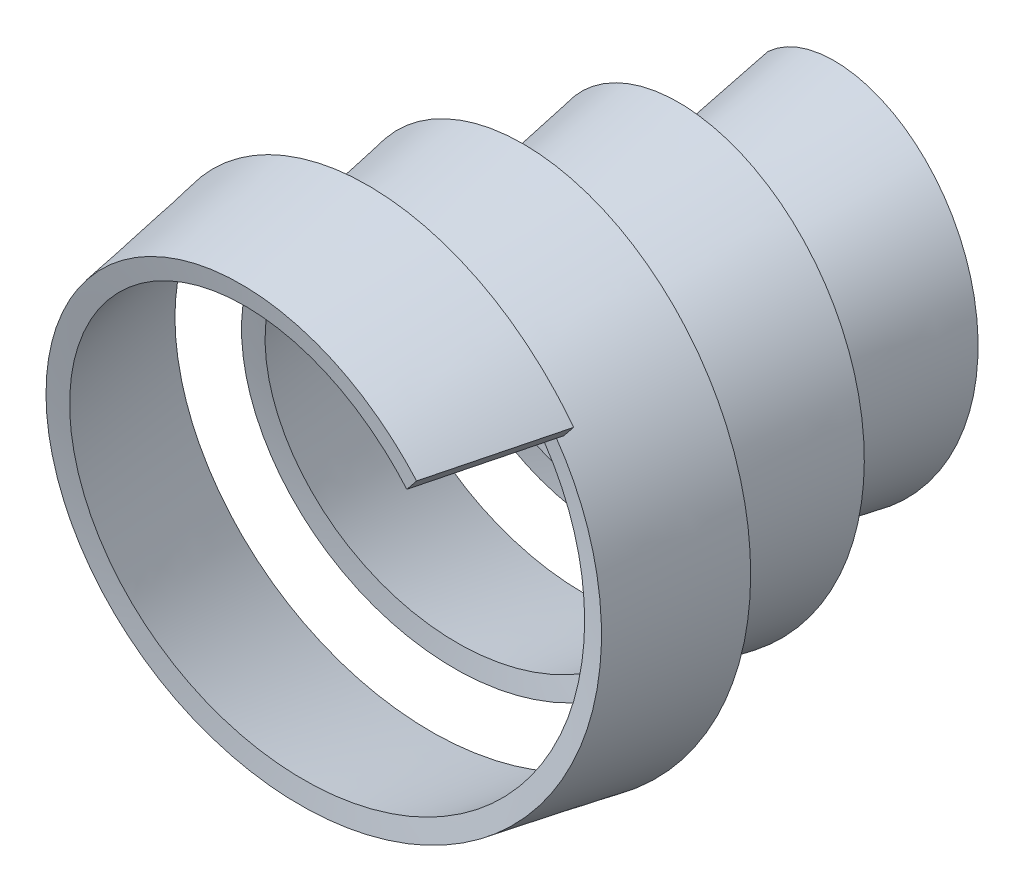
ISO-10303-21;
HEADER;
FILE_DESCRIPTION(('STEP AP214'),'2;1');
FILE_NAME('part.step','',(''),(''),'','','');
FILE_SCHEMA(('AUTOMOTIVE_DESIGN { 1 0 10303 214 1 1 1 1 }'));
ENDSEC;
DATA;
#1=APPLICATION_CONTEXT('core data for automotive mechanical design processes');
#2=APPLICATION_PROTOCOL_DEFINITION('international standard','automotive_design',2000,#1);
#3=PRODUCT_CONTEXT('',#1,'mechanical');
#4=PRODUCT('Part','Part','',(#3));
#5=PRODUCT_RELATED_PRODUCT_CATEGORY('part','',(#4));
#6=PRODUCT_DEFINITION_FORMATION('','',#4);
#7=PRODUCT_DEFINITION_CONTEXT('part definition',#1,'design');
#8=PRODUCT_DEFINITION('design','',#6,#7);
#9=PRODUCT_DEFINITION_SHAPE('','',#8);
#10=(LENGTH_UNIT() NAMED_UNIT(*) SI_UNIT(.MILLI.,.METRE.));
#11=(NAMED_UNIT(*) PLANE_ANGLE_UNIT() SI_UNIT($,.RADIAN.));
#12=(NAMED_UNIT(*) SI_UNIT($,.STERADIAN.) SOLID_ANGLE_UNIT());
#13=UNCERTAINTY_MEASURE_WITH_UNIT(LENGTH_MEASURE(1.E-05),#10,'distance_accuracy_value','');
#14=(GEOMETRIC_REPRESENTATION_CONTEXT(3) GLOBAL_UNCERTAINTY_ASSIGNED_CONTEXT((#13)) GLOBAL_UNIT_ASSIGNED_CONTEXT((#10,
#11,#12)) REPRESENTATION_CONTEXT('',''));
#15=CARTESIAN_POINT('',(0.,0.,0.));
#16=DIRECTION('',(0.,0.,1.));
#17=DIRECTION('',(1.,0.,0.));
#18=AXIS2_PLACEMENT_3D('',#15,#16,#17);
#19=CARTESIAN_POINT('',(-96.2316486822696,110.655025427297,-59.1060436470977));
#20=DIRECTION('',(0.658178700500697,0.729175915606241,0.187358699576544));
#21=DIRECTION('',(-0.742321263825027,0.67004413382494,0.));
#22=AXIS2_PLACEMENT_3D('',#19,#20,#21);
#23=PLANE('',#22);
#24=DIRECTION('',(0.,-0.248862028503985,0.968538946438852));
#25=VECTOR('',#24,1.);
#26=CARTESIAN_POINT('',(-96.2316486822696,79.5472718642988,61.9613246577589));
#27=LINE('',#26,#25);
#28=CARTESIAN_POINT('',(-96.2316486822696,110.655025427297,-59.1060436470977));
#29=VERTEX_POINT('',#28);
#30=CARTESIAN_POINT('',(-96.2316486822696,79.5472718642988,61.9613246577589));
#31=VERTEX_POINT('',#30);
#32=EDGE_CURVE('E67',#29,#31,#27,.T.);
#33=ORIENTED_EDGE('',*,*,#32,.F.);
#34=DIRECTION('',(-0.752861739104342,0.637471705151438,0.16379568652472));
#35=VECTOR('',#34,1.);
#36=CARTESIAN_POINT('',(-81.1744139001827,97.9055913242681,-62.3819573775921));
#37=LINE('',#36,#35);
#38=CARTESIAN_POINT('',(-81.1744139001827,97.9055913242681,-62.3819573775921));
#39=VERTEX_POINT('',#38);
#40=EDGE_CURVE('E71',#39,#29,#37,.T.);
#41=ORIENTED_EDGE('',*,*,#40,.F.);
#42=DIRECTION('',(0.,0.248862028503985,-0.968538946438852));
#43=VECTOR('',#42,1.);
#44=CARTESIAN_POINT('',(-81.1744139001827,66.79783776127,58.6854109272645));
#45=LINE('',#44,#43);
#46=CARTESIAN_POINT('',(-81.1744139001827,66.79783776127,58.6854109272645));
#47=VERTEX_POINT('',#46);
#48=EDGE_CURVE('E74',#47,#39,#45,.T.);
#49=ORIENTED_EDGE('',*,*,#48,.F.);
#50=DIRECTION('',(0.752861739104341,-0.637471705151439,-0.163795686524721));
#51=VECTOR('',#50,1.);
#52=CARTESIAN_POINT('',(-81.1744139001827,66.79783776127,58.6854109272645));
#53=LINE('',#52,#51);
#54=EDGE_CURVE('E62',#31,#47,#53,.T.);
#55=ORIENTED_EDGE('',*,*,#54,.F.);
#56=EDGE_LOOP('',(#33,#41,#49,#55));
#57=FACE_BOUND('',#56,.T.);
#58=ADVANCED_FACE('F33',(#57),#23,.F.);
#59=CARTESIAN_POINT('',(203.021012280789,188.597635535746,428.393956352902));
#60=DIRECTION('',(0.729175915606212,-0.658178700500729,0.187358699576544));
#61=DIRECTION('',(0.670044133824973,0.742321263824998,0.));
#62=AXIS2_PLACEMENT_3D('',#59,#60,#61);
#63=PLANE('',#62);
#64=DIRECTION('',(-0.248862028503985,0.,0.968538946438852));
#65=VECTOR('',#64,1.);
#66=CARTESIAN_POINT('',(171.913258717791,188.597635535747,549.461324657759));
#67=LINE('',#66,#65);
#68=CARTESIAN_POINT('',(203.021012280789,188.597635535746,428.393956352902));
#69=VERTEX_POINT('',#68);
#70=CARTESIAN_POINT('',(171.913258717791,188.597635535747,549.461324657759));
#71=VERTEX_POINT('',#70);
#72=EDGE_CURVE('E40',#69,#71,#67,.T.);
#73=ORIENTED_EDGE('',*,*,#72,.T.);
#74=DIRECTION('',(-0.637471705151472,-0.752861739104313,-0.163795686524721));
#75=VECTOR('',#74,1.);
#76=CARTESIAN_POINT('',(159.163824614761,173.540400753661,546.185410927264));
#77=LINE('',#76,#75);
#78=CARTESIAN_POINT('',(159.163824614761,173.540400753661,546.185410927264));
#79=VERTEX_POINT('',#78);
#80=EDGE_CURVE('E11',#71,#79,#77,.T.);
#81=ORIENTED_EDGE('',*,*,#80,.T.);
#82=DIRECTION('',(0.248862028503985,0.,-0.968538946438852));
#83=VECTOR('',#82,1.);
#84=CARTESIAN_POINT('',(159.163824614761,173.540400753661,546.185410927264));
#85=LINE('',#84,#83);
#86=CARTESIAN_POINT('',(190.27157817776,173.540400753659,425.118042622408));
#87=VERTEX_POINT('',#86);
#88=EDGE_CURVE('E89',#79,#87,#85,.T.);
#89=ORIENTED_EDGE('',*,*,#88,.T.);
#90=DIRECTION('',(0.637471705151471,0.752861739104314,0.16379568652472));
#91=VECTOR('',#90,1.);
#92=CARTESIAN_POINT('',(190.27157817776,173.540400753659,425.118042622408));
#93=LINE('',#92,#91);
#94=EDGE_CURVE('E51',#87,#69,#93,.T.);
#95=ORIENTED_EDGE('',*,*,#94,.T.);
#96=EDGE_LOOP('',(#73,#81,#89,#95));
#97=FACE_BOUND('',#96,.T.);
#98=ADVANCED_FACE('F120',(#97),#63,.T.);
#99=CARTESIAN_POINT('',(-81.1744139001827,66.79783776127,58.6854109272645));
#100=CARTESIAN_POINT('',(-74.5511803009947,75.9122354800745,61.2244563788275));
#101=CARTESIAN_POINT('',(-66.3837217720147,84.0380153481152,63.7635359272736));
#102=CARTESIAN_POINT('',(-47.6998720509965,97.386882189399,68.8416609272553));
#103=CARTESIAN_POINT('',(-37.1862285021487,102.606902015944,71.3807234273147));
#104=CARTESIAN_POINT('',(-14.828640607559,109.48494769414,76.4588484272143));
#105=CARTESIAN_POINT('',(-2.98840258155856,111.140867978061,78.9979109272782));
#106=CARTESIAN_POINT('',(20.8260321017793,110.584376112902,84.0760359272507));
#107=CARTESIAN_POINT('',(32.7959754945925,108.371140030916,86.6150984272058));
#108=CARTESIAN_POINT('',(55.6167764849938,100.167925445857,91.6932234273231));
#109=CARTESIAN_POINT('',(66.4632712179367,94.1785339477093,94.2322859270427));
#110=CARTESIAN_POINT('',(85.8584297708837,78.9164505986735,99.3104109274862));
#111=CARTESIAN_POINT('',(94.4030836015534,69.645738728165,101.849473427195));
#112=CARTESIAN_POINT('',(108.217519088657,48.6775870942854,106.927598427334));
#113=CARTESIAN_POINT('',(113.484082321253,36.9833527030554,109.466660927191));
#114=CARTESIAN_POINT('',(120.077096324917,12.3092813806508,114.544785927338));
#115=CARTESIAN_POINT('',(121.401487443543,-0.66642832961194,117.083848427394));
#116=CARTESIAN_POINT('',(119.837236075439,-26.5890697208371,122.161973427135));
#117=CARTESIAN_POINT('',(116.947947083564,-39.5313632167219,124.701035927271));
#118=CARTESIAN_POINT('',(107.117195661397,-64.0327122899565,129.779160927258));
#119=CARTESIAN_POINT('',(100.176611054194,-75.5870960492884,132.318223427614));
#120=CARTESIAN_POINT('',(82.8347263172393,-96.0596470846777,137.396348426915));
#121=CARTESIAN_POINT('',(72.435780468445,-104.973603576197,139.935410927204));
#122=CARTESIAN_POINT('',(49.150403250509,-119.148970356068,145.013535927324));
#123=CARTESIAN_POINT('',(36.2675964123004,-124.407090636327,147.552598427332));
#124=CARTESIAN_POINT('',(9.27886208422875,-130.60535728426,152.630723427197));
#125=CARTESIAN_POINT('',(-4.82251752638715,-131.543509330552,155.169785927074));
#126=CARTESIAN_POINT('',(-32.8169647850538,-128.867942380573,160.247910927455));
#127=CARTESIAN_POINT('',(-46.7050156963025,-125.253772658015,162.786973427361));
#128=CARTESIAN_POINT('',(-72.8196380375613,-113.708702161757,167.865098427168));
#129=CARTESIAN_POINT('',(-85.0412405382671,-105.778985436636,170.404160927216));
#130=CARTESIAN_POINT('',(-106.499907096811,-86.2961937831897,175.482285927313));
#131=CARTESIAN_POINT('',(-115.73257568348,-74.7458583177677,178.021348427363));
#132=CARTESIAN_POINT('',(-130.162930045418,-49.1141050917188,183.099473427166));
#133=CARTESIAN_POINT('',(-135.357272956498,-35.0367362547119,185.638535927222));
#134=CARTESIAN_POINT('',(-141.051026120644,-5.73915263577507,190.716660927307));
#135=CARTESIAN_POINT('',(-141.548526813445,9.47609455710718,193.255723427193));
#136=CARTESIAN_POINT('',(-137.659299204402,39.5021406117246,198.333848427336));
#137=CARTESIAN_POINT('',(-133.272334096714,54.307551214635,200.872910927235));
#138=CARTESIAN_POINT('',(-119.928511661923,81.9649409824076,205.951035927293));
#139=CARTESIAN_POINT('',(-110.973159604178,94.8116665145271,208.490098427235));
#140=CARTESIAN_POINT('',(-89.2916040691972,117.162845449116,213.568223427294));
#141=CARTESIAN_POINT('',(-76.5685355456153,126.662735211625,216.107285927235));
#142=CARTESIAN_POINT('',(-48.5650726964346,141.2409495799,221.185410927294));
#143=CARTESIAN_POINT('',(-33.2891562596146,146.315897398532,223.724473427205));
#144=CARTESIAN_POINT('',(-1.69253313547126,151.395450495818,228.802598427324));
#145=CARTESIAN_POINT('',(14.6227878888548,151.398250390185,231.34166092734));
#146=CARTESIAN_POINT('',(46.6364577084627,146.194352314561,236.419785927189));
#147=CARTESIAN_POINT('',(62.3290544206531,140.987649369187,238.958848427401));
#148=CARTESIAN_POINT('',(91.455550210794,125.763097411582,244.036973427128));
#149=CARTESIAN_POINT('',(104.883923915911,115.747089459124,246.576035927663));
#150=CARTESIAN_POINT('',(128.031790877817,91.812238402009,251.654160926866));
#151=CARTESIAN_POINT('',(137.746569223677,77.8969354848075,254.193223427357));
#152=CARTESIAN_POINT('',(152.36445597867,47.5002860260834,259.271348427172));
#153=CARTESIAN_POINT('',(157.264172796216,31.0238502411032,261.81041092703));
#154=CARTESIAN_POINT('',(161.620048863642,-2.85800770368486,266.888535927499));
#155=CARTESIAN_POINT('',(161.074526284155,-20.2576284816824,269.427598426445));
#156=CARTESIAN_POINT('',(154.456406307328,-54.2112211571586,274.505723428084));
#157=CARTESIAN_POINT('',(148.384053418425,-70.7590855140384,277.044785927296));
#158=CARTESIAN_POINT('',(131.19935323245,-101.277949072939,282.122910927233));
#159=CARTESIAN_POINT('',(120.089196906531,-115.243164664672,284.661973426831));
#160=CARTESIAN_POINT('',(93.8499175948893,-139.089781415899,289.740098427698));
#161=CARTESIAN_POINT('',(78.7247491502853,-148.966333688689,292.279160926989));
#162=CARTESIAN_POINT('',(45.9173287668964,-163.514770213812,297.35728592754));
#163=CARTESIAN_POINT('',(28.2404236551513,-168.183267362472,299.896348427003));
#164=CARTESIAN_POINT('',(-7.90887469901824,-171.706329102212,304.974473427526));
#165=CARTESIAN_POINT('',(-26.3750538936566,-170.559354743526,307.513535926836));
#166=CARTESIAN_POINT('',(-62.217188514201,-162.429041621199,312.591660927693));
#167=CARTESIAN_POINT('',(-79.586689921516,-155.446214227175,315.130723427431));
#168=CARTESIAN_POINT('',(-111.418188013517,-136.224607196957,320.208848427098));
#169=CARTESIAN_POINT('',(-125.874156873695,-123.98838209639,322.74791092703));
#170=CARTESIAN_POINT('',(-150.319580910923,-95.3970109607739,327.826035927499));
#171=CARTESIAN_POINT('',(-160.304070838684,-79.0462423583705,330.365098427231));
#172=CARTESIAN_POINT('',(-174.673125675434,-43.8143916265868,335.443223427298));
#173=CARTESIAN_POINT('',(-179.054327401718,-24.9390949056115,337.982285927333));
#174=CARTESIAN_POINT('',(-181.635907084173,13.4558688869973,343.060410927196));
#175=CARTESIAN_POINT('',(-179.834908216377,32.9689129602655,345.599473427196));
#176=CARTESIAN_POINT('',(-170.096131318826,70.6445781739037,350.677598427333));
#177=CARTESIAN_POINT('',(-162.159148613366,88.800408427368,353.216660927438));
#178=CARTESIAN_POINT('',(-140.826634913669,121.861897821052,358.294785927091));
#179=CARTESIAN_POINT('',(-127.434035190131,136.761299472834,360.833848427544));
#180=CARTESIAN_POINT('',(-96.4464447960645,161.703695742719,365.911973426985));
#181=CARTESIAN_POINT('',(-78.8562623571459,171.74162672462,368.451035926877));
#182=CARTESIAN_POINT('',(-41.190275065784,185.820686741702,373.529160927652));
#183=CARTESIAN_POINT('',(-21.1206960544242,189.858496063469,376.068223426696));
#184=CARTESIAN_POINT('',(19.4941907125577,191.390525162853,381.146348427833));
#185=CARTESIAN_POINT('',(40.0324709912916,188.883549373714,383.685410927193));
#186=CARTESIAN_POINT('',(79.4830782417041,177.44185763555,388.763535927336));
#187=CARTESIAN_POINT('',(98.388287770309,168.508237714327,391.302598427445));
#188=CARTESIAN_POINT('',(132.594303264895,144.993672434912,396.380723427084));
#189=CARTESIAN_POINT('',(147.888637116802,130.416047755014,398.919785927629));
#190=CARTESIAN_POINT('',(173.224391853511,96.9917103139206,403.9979109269));
#191=CARTESIAN_POINT('',(183.260668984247,78.1502438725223,406.536973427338));
#192=CARTESIAN_POINT('',(196.938567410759,38.0443915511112,411.615098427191));
#193=CARTESIAN_POINT('',(200.576932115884,16.7866730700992,414.154160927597));
#194=CARTESIAN_POINT('',(200.952070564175,-26.018443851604,419.232285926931));
#195=CARTESIAN_POINT('',(197.687849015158,-47.5584154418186,421.771348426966));
#196=CARTESIAN_POINT('',(184.450728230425,-88.721855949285,426.849473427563));
#197=CARTESIAN_POINT('',(174.479242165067,-108.337891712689,429.388535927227));
#198=CARTESIAN_POINT('',(148.714428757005,-143.600237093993,434.466660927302));
#199=CARTESIAN_POINT('',(132.924823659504,-159.239875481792,437.005723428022));
#200=CARTESIAN_POINT('',(97.0268711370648,-184.863711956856,442.083848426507));
#201=CARTESIAN_POINT('',(76.9242147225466,-194.842704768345,444.622910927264));
#202=CARTESIAN_POINT('',(34.3767671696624,-208.007850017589,449.701035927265));
#203=CARTESIAN_POINT('',(11.9390854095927,-211.190828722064,452.240098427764));
#204=CARTESIAN_POINT('',(-33.0226394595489,-210.302593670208,457.318223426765));
#205=CARTESIAN_POINT('',(-55.5388622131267,-206.230603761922,459.857285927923));
#206=CARTESIAN_POINT('',(-98.3495674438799,-191.10759220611,464.935410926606));
#207=CARTESIAN_POINT('',(-118.636312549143,-180.058316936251,467.474473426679));
#208=CARTESIAN_POINT('',(-154.86415440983,-151.978097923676,472.55259842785));
#209=CARTESIAN_POINT('',(-170.798396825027,-134.951289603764,475.091660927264));
#210=CARTESIAN_POINT('',(-196.603493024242,-96.5465701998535,480.169785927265));
#211=CARTESIAN_POINT('',(-206.46909884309,-75.1748008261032,482.708848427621));
#212=CARTESIAN_POINT('',(-219.009603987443,-30.188042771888,487.786973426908));
#213=CARTESIAN_POINT('',(-221.681432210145,-6.58060520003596,490.326035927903));
#214=CARTESIAN_POINT('',(-219.424326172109,40.5002011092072,495.404160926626));
#215=CARTESIAN_POINT('',(-214.49485359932,63.9653624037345,497.943223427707));
#216=CARTESIAN_POINT('',(-197.397655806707,108.354368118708,503.021348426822));
#217=CARTESIAN_POINT('',(-185.23202587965,129.270183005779,505.56041092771));
#218=CARTESIAN_POINT('',(-154.774370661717,166.37014744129,510.638535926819));
#219=CARTESIAN_POINT('',(-136.486905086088,182.547275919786,513.177598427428));
#220=CARTESIAN_POINT('',(-95.5460362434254,208.425383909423,518.255723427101));
#221=CARTESIAN_POINT('',(-72.8992307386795,218.121091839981,520.794785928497));
#222=CARTESIAN_POINT('',(-25.4794745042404,229.924904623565,525.872910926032));
#223=CARTESIAN_POINT('',(-0.714515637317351,232.030060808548,528.411973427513));
#224=CARTESIAN_POINT('',(48.4439700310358,228.299699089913,533.490098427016));
#225=CARTESIAN_POINT('',(72.828909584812,222.463899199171,536.029160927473));
#226=CARTESIAN_POINT('',(118.723923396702,203.306497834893,541.107285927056));
#227=CARTESIAN_POINT('',(140.223444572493,189.989304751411,543.646047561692));
#228=CARTESIAN_POINT('',(159.163824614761,173.540400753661,546.185410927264));
#229=CARTESIAN_POINT('',(-81.1744139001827,97.9055913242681,-62.3819573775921));
#230=CARTESIAN_POINT('',(-71.2426105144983,107.020076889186,-59.8428874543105));
#231=CARTESIAN_POINT('',(-59.7672979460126,114.613518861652,-57.3038323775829));
#232=CARTESIAN_POINT('',(-34.8004273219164,125.886755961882,-52.2257073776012));
#233=CARTESIAN_POINT('',(-21.3127704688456,129.56375289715,-49.6866448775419));
#234=CARTESIAN_POINT('',(6.35963568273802,132.500060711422,-44.6085198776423));
#235=CARTESIAN_POINT('',(20.5397650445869,131.757943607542,-42.0694573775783));
#236=CARTESIAN_POINT('',(48.1643182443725,125.791499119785,-36.9913323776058));
#237=CARTESIAN_POINT('',(61.6038338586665,120.567277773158,-34.452269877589));
#238=CARTESIAN_POINT('',(86.3454463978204,106.031996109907,-29.3741448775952));
#239=CARTESIAN_POINT('',(97.642850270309,96.7226112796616,-26.835082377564));
#240=CARTESIAN_POINT('',(116.875619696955,74.8455282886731,-21.7569573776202));
#241=CARTESIAN_POINT('',(124.807003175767,62.2809472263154,-19.2178948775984));
#242=CARTESIAN_POINT('',(136.392241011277,35.0826055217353,-14.1397698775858));
#243=CARTESIAN_POINT('',(140.043260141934,20.4531212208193,-11.6007073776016));
#244=CARTESIAN_POINT('',(142.565291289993,-9.43743254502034,-6.52258237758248));
#245=CARTESIAN_POINT('',(141.434943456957,-24.6934780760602,-3.98351987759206));
#246=CARTESIAN_POINT('',(134.368863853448,-54.2923235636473,1.09460512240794));
#247=CARTESIAN_POINT('',(128.433431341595,-68.6298533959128,3.63366762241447));
#248=CARTESIAN_POINT('',(112.225380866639,-94.8960388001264,8.71179262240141));
#249=CARTESIAN_POINT('',(101.954736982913,-106.819719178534,11.2508551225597));
#250=CARTESIAN_POINT('',(78.0038301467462,-126.967589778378,16.3289801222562));
#251=CARTESIAN_POINT('',(64.32705756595,-135.187625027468,18.8680426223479));
#252=CARTESIAN_POINT('',(34.8680739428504,-146.981569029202,23.9461676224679));
#253=CARTESIAN_POINT('',(19.0905486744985,-150.552597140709,26.4852301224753));
#254=CARTESIAN_POINT('',(-13.0131900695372,-152.553088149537,31.5633551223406));
#255=CARTESIAN_POINT('',(-29.3339763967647,-150.981278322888,34.1024176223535));
#256=CARTESIAN_POINT('',(-60.868498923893,-142.715321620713,39.1805426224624));
#257=CARTESIAN_POINT('',(-76.0766098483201,-136.021685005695,41.7196051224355));
#258=CARTESIAN_POINT('',(-103.799030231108,-118.057924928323,46.7977301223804));
#259=CARTESIAN_POINT('',(-116.308094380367,-106.790088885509,49.3367926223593));
#260=CARTESIAN_POINT('',(-137.279984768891,-80.7082337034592,54.4149176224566));
#261=CARTESIAN_POINT('',(-145.738499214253,-65.8980884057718,56.9539801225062));
#262=CARTESIAN_POINT('',(-157.636640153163,-34.1530311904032,62.0321051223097));
#263=CARTESIAN_POINT('',(-161.073359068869,-17.2232190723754,64.5711676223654));
#264=CARTESIAN_POINT('',(-162.445072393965,17.0848098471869,69.6492926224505));
#265=CARTESIAN_POINT('',(-160.378900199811,34.4571977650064,72.1883551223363));
#266=CARTESIAN_POINT('',(-150.814088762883,67.8850578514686,77.2664801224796));
#267=CARTESIAN_POINT('',(-143.316188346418,83.9345569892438,79.805542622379));
#268=CARTESIAN_POINT('',(-123.516152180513,113.041738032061,84.8836676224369));
#269=CARTESIAN_POINT('',(-111.216631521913,126.093917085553,87.4227301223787));
#270=CARTESIAN_POINT('',(-82.9499460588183,147.796517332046,92.5008551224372));
#271=CARTESIAN_POINT('',(-66.9870481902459,156.442486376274,95.0399176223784));
#272=CARTESIAN_POINT('',(-32.9342661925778,168.339221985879,100.118042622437));
#273=CARTESIAN_POINT('',(-14.849899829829,171.587072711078,102.657105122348));
#274=CARTESIAN_POINT('',(21.6495913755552,172.222925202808,107.735230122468));
#275=CARTESIAN_POINT('',(40.058487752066,169.609885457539,110.274292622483));
#276=CARTESIAN_POINT('',(75.3336612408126,158.648628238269,115.352417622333));
#277=CARTESIAN_POINT('',(92.1936256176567,150.30139547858,117.891480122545));
#278=CARTESIAN_POINT('',(122.61103261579,128.586994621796,122.969605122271));
#279=CARTESIAN_POINT('',(136.162727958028,115.222783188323,125.508667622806));
#280=CARTESIAN_POINT('',(158.500604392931,84.7207024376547,130.58679262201));
#281=CARTESIAN_POINT('',(167.282209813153,67.5875022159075,133.125855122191));
#282=CARTESIAN_POINT('',(179.070967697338,31.2091623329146,138.203980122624));
#283=CARTESIAN_POINT('',(182.075214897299,11.9699616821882,140.743042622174));
#284=CARTESIAN_POINT('',(181.868406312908,-26.7042338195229,145.821167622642));
#285=CARTESIAN_POINT('',(178.656453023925,-46.1326034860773,148.360230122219));
#286=CARTESIAN_POINT('',(166.202666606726,-83.205424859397,153.438355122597));
#287=CARTESIAN_POINT('',(156.962081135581,-100.843232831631,155.97741762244));
#288=CARTESIAN_POINT('',(133.257806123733,-132.493349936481,161.055542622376));
#289=CARTESIAN_POINT('',(118.797428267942,-146.499680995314,163.594605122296));
#290=CARTESIAN_POINT('',(86.0127753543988,-169.375383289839,168.67273012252));
#291=CARTESIAN_POINT('',(67.6935799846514,-178.240072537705,171.211792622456));
#292=CARTESIAN_POINT('',(28.9757010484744,-189.813434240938,176.289917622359));
#293=CARTESIAN_POINT('',(8.58338031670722,-192.519231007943,178.82898012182));
#294=CARTESIAN_POINT('',(-32.244838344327,-191.363372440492,183.907105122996));
#295=CARTESIAN_POINT('',(-52.6737179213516,-187.500982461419,186.44616762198));
#296=CARTESIAN_POINT('',(-91.4909273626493,-173.460210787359,191.524292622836));
#297=CARTESIAN_POINT('',(-109.872291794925,-163.283356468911,194.063355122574));
#298=CARTESIAN_POINT('',(-142.67470434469,-137.516375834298,199.141480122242));
#299=CARTESIAN_POINT('',(-157.089557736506,-121.929929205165,201.680542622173));
#300=CARTESIAN_POINT('',(-180.403728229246,-86.8189832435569,206.758667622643));
#301=CARTESIAN_POINT('',(-189.298274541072,-67.2999820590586,209.297730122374));
#302=CARTESIAN_POINT('',(-200.548100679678,-26.2324648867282,214.375855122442));
#303=CARTESIAN_POINT('',(-202.900553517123,-4.69073745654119,216.914917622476));
#304=CARTESIAN_POINT('',(-200.689795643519,38.2669109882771,221.99304262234));
#305=CARTESIAN_POINT('',(-196.126031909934,59.675424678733,224.532105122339));
#306=CARTESIAN_POINT('',(-180.405564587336,100.180218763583,229.610230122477));
#307=CARTESIAN_POINT('',(-169.250684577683,119.269221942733,232.149292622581));
#308=CARTESIAN_POINT('',(-141.350941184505,153.140701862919,237.227417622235));
#309=CARTESIAN_POINT('',(-124.610137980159,167.916781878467,239.766480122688));
#310=CARTESIAN_POINT('',(-87.1326986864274,191.568266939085,244.844605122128));
#311=CARTESIAN_POINT('',(-66.4019864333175,200.43883025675,247.38366762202));
#312=CARTESIAN_POINT('',(-22.9786399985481,211.256386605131,252.461792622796));
#313=CARTESIAN_POINT('',(-0.293221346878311,213.20062057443,255.000855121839));
#314=CARTESIAN_POINT('',(44.7653660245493,209.829781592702,260.078980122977));
#315=CARTESIAN_POINT('',(67.1307433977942,204.514355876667,262.618042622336));
#316=CARTESIAN_POINT('',(109.26282940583,187.023344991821,267.69616762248));
#317=CARTESIAN_POINT('',(129.021959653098,174.849895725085,270.235230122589));
#318=CARTESIAN_POINT('',(163.876553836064,144.750200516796,275.313355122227));
#319=CARTESIAN_POINT('',(178.965434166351,126.828407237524,277.852417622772));
#320=CARTESIAN_POINT('',(202.851397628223,86.9478560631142,282.930542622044));
#321=CARTESIAN_POINT('',(211.643586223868,64.9954543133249,285.469605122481));
#322=CARTESIAN_POINT('',(221.919670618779,19.2140181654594,290.547730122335));
#323=CARTESIAN_POINT('',(223.400894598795,-4.6073732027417,293.086792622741));
#324=CARTESIAN_POINT('',(218.76558774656,-51.7345299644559,298.164917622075));
#325=CARTESIAN_POINT('',(212.648922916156,-75.0321255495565,300.70398012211));
#326=CARTESIAN_POINT('',(193.298498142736,-118.727779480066,305.782105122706));
#327=CARTESIAN_POINT('',(180.067202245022,-139.117969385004,308.32116762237));
#328=CARTESIAN_POINT('',(147.703325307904,-174.86709093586,313.399292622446));
#329=CARTESIAN_POINT('',(128.575600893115,-190.219267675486,315.938355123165));
#330=CARTESIAN_POINT('',(86.2589587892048,-214.235306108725,321.01648012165));
#331=CARTESIAN_POINT('',(63.0768354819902,-222.894238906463,323.555542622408));
#332=CARTESIAN_POINT('',(14.9389981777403,-232.519308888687,328.633667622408));
#333=CARTESIAN_POINT('',(-10.0086454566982,-233.482880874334,331.172730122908));
#334=CARTESIAN_POINT('',(-59.1681459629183,-227.479641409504,336.250855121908));
#335=CARTESIAN_POINT('',(-83.3714608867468,-220.512933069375,338.789917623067));
#336=CARTESIAN_POINT('',(-128.563588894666,-199.216315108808,343.868042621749));
#337=CARTESIAN_POINT('',(-149.544255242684,-184.889213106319,346.407105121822));
#338=CARTESIAN_POINT('',(-186.096777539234,-150.199971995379,351.485230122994));
#339=CARTESIAN_POINT('',(-201.661723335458,-129.843104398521,354.024292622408));
#340=CARTESIAN_POINT('',(-225.70198320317,-85.0610859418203,359.102417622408));
#341=CARTESIAN_POINT('',(-234.172352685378,-60.6431730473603,361.641480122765));
#342=CARTESIAN_POINT('',(-243.036653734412,-10.1545867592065,366.719605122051));
#343=CARTESIAN_POINT('',(-243.428146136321,15.9075897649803,369.258667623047));
#344=CARTESIAN_POINT('',(-235.954557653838,67.0593789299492,374.336792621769));
#345=CARTESIAN_POINT('',(-228.089835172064,92.1400843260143,376.87585512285));
#346=CARTESIAN_POINT('',(-204.76244730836,138.758287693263,381.953980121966));
#347=CARTESIAN_POINT('',(-189.302948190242,160.287372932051,384.493042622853));
#348=CARTESIAN_POINT('',(-152.23029332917,197.549726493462,389.571167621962));
#349=CARTESIAN_POINT('',(-130.622834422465,213.275945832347,392.110230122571));
#350=CARTESIAN_POINT('',(-83.3498985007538,237.233242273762,397.188355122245));
#351=CARTESIAN_POINT('',(-57.6921077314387,245.459377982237,399.727417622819));
#352=CARTESIAN_POINT('',(-4.86239887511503,253.453072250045,404.805542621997));
#353=CARTESIAN_POINT('',(22.3005973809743,253.218337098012,407.344605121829));
#354=CARTESIAN_POINT('',(75.4008209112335,244.173157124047,412.422730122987));
#355=CARTESIAN_POINT('',(101.328783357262,235.363343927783,414.961792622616));
#356=CARTESIAN_POINT('',(149.299426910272,209.922921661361,420.0399176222));
#357=CARTESIAN_POINT('',(171.331270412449,193.298117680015,422.578688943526));
#358=CARTESIAN_POINT('',(190.27157817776,173.540400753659,425.118042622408));
#359=B_SPLINE_SURFACE_WITH_KNOTS('',1,3,((#99,#100,#101,#102,#103,#104,#105,#106,#107,#108,#109,
#110,#111,#112,#113,#114,#115,#116,#117,#118,#119,#120,#121,#122,#123,#124,#125,#126,#127,#128,
#129,#130,#131,#132,#133,#134,#135,#136,#137,#138,#139,#140,#141,#142,#143,#144,#145,#146,#147,
#148,#149,#150,#151,#152,#153,#154,#155,#156,#157,#158,#159,#160,#161,#162,#163,#164,#165,#166,
#167,#168,#169,#170,#171,#172,#173,#174,#175,#176,#177,#178,#179,#180,#181,#182,#183,#184,#185,
#186,#187,#188,#189,#190,#191,#192,#193,#194,#195,#196,#197,#198,#199,#200,#201,#202,#203,#204,
#205,#206,#207,#208,#209,#210,#211,#212,#213,#214,#215,#216,#217,#218,#219,#220,#221,#222,#223,
#224,#225,#226,#227,#228),(#229,#230,#231,#232,#233,#234,#235,#236,#237,#238,#239,#240,#241,
#242,#243,#244,#245,#246,#247,#248,#249,#250,#251,#252,#253,#254,#255,#256,#257,#258,#259,#260,
#261,#262,#263,#264,#265,#266,#267,#268,#269,#270,#271,#272,#273,#274,#275,#276,#277,#278,#279,
#280,#281,#282,#283,#284,#285,#286,#287,#288,#289,#290,#291,#292,#293,#294,#295,#296,#297,#298,
#299,#300,#301,#302,#303,#304,#305,#306,#307,#308,#309,#310,#311,#312,#313,#314,#315,#316,#317,
#318,#319,#320,#321,#322,#323,#324,#325,#326,#327,#328,#329,#330,#331,#332,#333,#334,#335,#336,
#337,#338,#339,#340,#341,#342,#343,#344,#345,#346,#347,#348,#349,#350,#351,#352,#353,#354,#355,
#356,#357,#358)),.UNSPECIFIED.,.F.,.F.,.F.,(2,2),(4,2,2,2,2,2,2,2,2,2,2,2,2,2,2,2,2,2,2,2,2,2,2,
2,2,2,2,2,2,2,2,2,2,2,2,2,2,2,2,2,2,2,2,2,2,2,2,2,2,2,2,2,2,2,2,2,2,2,2,2,2,2,2,2,4),(0.,1.),
(0.,0.015625,0.03125,0.046875,0.0625,0.078125,0.09375,0.109375,0.125,0.140625,0.15625,0.171875,
0.1875,0.203125,0.21875,0.234375,0.25,0.265625,0.28125,0.296875,0.3125,0.328125,0.34375,
0.359375,0.375,0.390625,0.40625,0.421875,0.4375,0.453125,0.46875,0.484375,0.5,0.515625,0.53125,
0.546875,0.5625,0.578125,0.59375,0.609375,0.625,0.640625,0.65625,0.671875,0.6875,0.703125,
0.71875,0.734375,0.75,0.765625,0.78125,0.796875,0.8125,0.828125,0.84375,0.859375,0.875,0.890625,
0.90625,0.921875,0.9375,0.953125,0.96875,0.984375,1.),.UNSPECIFIED.);
#360=CARTESIAN_POINT('',(-81.1744139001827,97.9055913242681,-62.3819573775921));
#361=CARTESIAN_POINT('',(-71.2426105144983,107.020076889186,-59.8428874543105));
#362=CARTESIAN_POINT('',(-59.7672979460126,114.613518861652,-57.3038323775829));
#363=CARTESIAN_POINT('',(-34.8004273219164,125.886755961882,-52.2257073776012));
#364=CARTESIAN_POINT('',(-21.3127704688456,129.56375289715,-49.6866448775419));
#365=CARTESIAN_POINT('',(6.35963568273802,132.500060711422,-44.6085198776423));
#366=CARTESIAN_POINT('',(20.5397650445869,131.757943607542,-42.0694573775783));
#367=CARTESIAN_POINT('',(48.1643182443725,125.791499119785,-36.9913323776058));
#368=CARTESIAN_POINT('',(61.6038338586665,120.567277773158,-34.452269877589));
#369=CARTESIAN_POINT('',(86.3454463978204,106.031996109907,-29.3741448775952));
#370=CARTESIAN_POINT('',(97.642850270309,96.7226112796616,-26.835082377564));
#371=CARTESIAN_POINT('',(116.875619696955,74.8455282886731,-21.7569573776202));
#372=CARTESIAN_POINT('',(124.807003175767,62.2809472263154,-19.2178948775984));
#373=CARTESIAN_POINT('',(136.392241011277,35.0826055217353,-14.1397698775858));
#374=CARTESIAN_POINT('',(140.043260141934,20.4531212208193,-11.6007073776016));
#375=CARTESIAN_POINT('',(142.565291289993,-9.43743254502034,-6.52258237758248));
#376=CARTESIAN_POINT('',(141.434943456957,-24.6934780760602,-3.98351987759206));
#377=CARTESIAN_POINT('',(134.368863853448,-54.2923235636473,1.09460512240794));
#378=CARTESIAN_POINT('',(128.433431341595,-68.6298533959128,3.63366762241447));
#379=CARTESIAN_POINT('',(112.225380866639,-94.8960388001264,8.71179262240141));
#380=CARTESIAN_POINT('',(101.954736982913,-106.819719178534,11.2508551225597));
#381=CARTESIAN_POINT('',(78.0038301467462,-126.967589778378,16.3289801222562));
#382=CARTESIAN_POINT('',(64.32705756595,-135.187625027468,18.8680426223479));
#383=CARTESIAN_POINT('',(34.8680739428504,-146.981569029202,23.9461676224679));
#384=CARTESIAN_POINT('',(19.0905486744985,-150.552597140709,26.4852301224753));
#385=CARTESIAN_POINT('',(-13.0131900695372,-152.553088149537,31.5633551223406));
#386=CARTESIAN_POINT('',(-29.3339763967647,-150.981278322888,34.1024176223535));
#387=CARTESIAN_POINT('',(-60.868498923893,-142.715321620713,39.1805426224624));
#388=CARTESIAN_POINT('',(-76.0766098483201,-136.021685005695,41.7196051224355));
#389=CARTESIAN_POINT('',(-103.799030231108,-118.057924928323,46.7977301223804));
#390=CARTESIAN_POINT('',(-116.308094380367,-106.790088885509,49.3367926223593));
#391=CARTESIAN_POINT('',(-137.279984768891,-80.7082337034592,54.4149176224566));
#392=CARTESIAN_POINT('',(-145.738499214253,-65.8980884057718,56.9539801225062));
#393=CARTESIAN_POINT('',(-157.636640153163,-34.1530311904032,62.0321051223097));
#394=CARTESIAN_POINT('',(-161.073359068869,-17.2232190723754,64.5711676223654));
#395=CARTESIAN_POINT('',(-162.445072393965,17.0848098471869,69.6492926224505));
#396=CARTESIAN_POINT('',(-160.378900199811,34.4571977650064,72.1883551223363));
#397=CARTESIAN_POINT('',(-150.814088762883,67.8850578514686,77.2664801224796));
#398=CARTESIAN_POINT('',(-143.316188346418,83.9345569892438,79.805542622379));
#399=CARTESIAN_POINT('',(-123.516152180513,113.041738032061,84.8836676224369));
#400=CARTESIAN_POINT('',(-111.216631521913,126.093917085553,87.4227301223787));
#401=CARTESIAN_POINT('',(-82.9499460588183,147.796517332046,92.5008551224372));
#402=CARTESIAN_POINT('',(-66.9870481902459,156.442486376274,95.0399176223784));
#403=CARTESIAN_POINT('',(-32.9342661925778,168.339221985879,100.118042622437));
#404=CARTESIAN_POINT('',(-14.849899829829,171.587072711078,102.657105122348));
#405=CARTESIAN_POINT('',(21.6495913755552,172.222925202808,107.735230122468));
#406=CARTESIAN_POINT('',(40.058487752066,169.609885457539,110.274292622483));
#407=CARTESIAN_POINT('',(75.3336612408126,158.648628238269,115.352417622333));
#408=CARTESIAN_POINT('',(92.1936256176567,150.30139547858,117.891480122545));
#409=CARTESIAN_POINT('',(122.61103261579,128.586994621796,122.969605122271));
#410=CARTESIAN_POINT('',(136.162727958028,115.222783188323,125.508667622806));
#411=CARTESIAN_POINT('',(158.500604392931,84.7207024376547,130.58679262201));
#412=CARTESIAN_POINT('',(167.282209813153,67.5875022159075,133.125855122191));
#413=CARTESIAN_POINT('',(179.070967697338,31.2091623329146,138.203980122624));
#414=CARTESIAN_POINT('',(182.075214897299,11.9699616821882,140.743042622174));
#415=CARTESIAN_POINT('',(181.868406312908,-26.7042338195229,145.821167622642));
#416=CARTESIAN_POINT('',(178.656453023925,-46.1326034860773,148.360230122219));
#417=CARTESIAN_POINT('',(166.202666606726,-83.205424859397,153.438355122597));
#418=CARTESIAN_POINT('',(156.962081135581,-100.843232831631,155.97741762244));
#419=CARTESIAN_POINT('',(133.257806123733,-132.493349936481,161.055542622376));
#420=CARTESIAN_POINT('',(118.797428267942,-146.499680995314,163.594605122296));
#421=CARTESIAN_POINT('',(86.0127753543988,-169.375383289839,168.67273012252));
#422=CARTESIAN_POINT('',(67.6935799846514,-178.240072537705,171.211792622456));
#423=CARTESIAN_POINT('',(28.9757010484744,-189.813434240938,176.289917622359));
#424=CARTESIAN_POINT('',(8.58338031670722,-192.519231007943,178.82898012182));
#425=CARTESIAN_POINT('',(-32.244838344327,-191.363372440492,183.907105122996));
#426=CARTESIAN_POINT('',(-52.6737179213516,-187.500982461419,186.44616762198));
#427=CARTESIAN_POINT('',(-91.4909273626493,-173.460210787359,191.524292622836));
#428=CARTESIAN_POINT('',(-109.872291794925,-163.283356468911,194.063355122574));
#429=CARTESIAN_POINT('',(-142.67470434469,-137.516375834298,199.141480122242));
#430=CARTESIAN_POINT('',(-157.089557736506,-121.929929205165,201.680542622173));
#431=CARTESIAN_POINT('',(-180.403728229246,-86.8189832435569,206.758667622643));
#432=CARTESIAN_POINT('',(-189.298274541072,-67.2999820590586,209.297730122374));
#433=CARTESIAN_POINT('',(-200.548100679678,-26.2324648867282,214.375855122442));
#434=CARTESIAN_POINT('',(-202.900553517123,-4.69073745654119,216.914917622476));
#435=CARTESIAN_POINT('',(-200.689795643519,38.2669109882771,221.99304262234));
#436=CARTESIAN_POINT('',(-196.126031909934,59.675424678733,224.532105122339));
#437=CARTESIAN_POINT('',(-180.405564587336,100.180218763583,229.610230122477));
#438=CARTESIAN_POINT('',(-169.250684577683,119.269221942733,232.149292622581));
#439=CARTESIAN_POINT('',(-141.350941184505,153.140701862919,237.227417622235));
#440=CARTESIAN_POINT('',(-124.610137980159,167.916781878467,239.766480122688));
#441=CARTESIAN_POINT('',(-87.1326986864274,191.568266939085,244.844605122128));
#442=CARTESIAN_POINT('',(-66.4019864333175,200.43883025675,247.38366762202));
#443=CARTESIAN_POINT('',(-22.9786399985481,211.256386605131,252.461792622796));
#444=CARTESIAN_POINT('',(-0.293221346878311,213.20062057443,255.000855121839));
#445=CARTESIAN_POINT('',(44.7653660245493,209.829781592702,260.078980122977));
#446=CARTESIAN_POINT('',(67.1307433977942,204.514355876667,262.618042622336));
#447=CARTESIAN_POINT('',(109.26282940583,187.023344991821,267.69616762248));
#448=CARTESIAN_POINT('',(129.021959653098,174.849895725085,270.235230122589));
#449=CARTESIAN_POINT('',(163.876553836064,144.750200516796,275.313355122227));
#450=CARTESIAN_POINT('',(178.965434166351,126.828407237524,277.852417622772));
#451=CARTESIAN_POINT('',(202.851397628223,86.9478560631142,282.930542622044));
#452=CARTESIAN_POINT('',(211.643586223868,64.9954543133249,285.469605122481));
#453=CARTESIAN_POINT('',(221.919670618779,19.2140181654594,290.547730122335));
#454=CARTESIAN_POINT('',(223.400894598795,-4.6073732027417,293.086792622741));
#455=CARTESIAN_POINT('',(218.76558774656,-51.7345299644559,298.164917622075));
#456=CARTESIAN_POINT('',(212.648922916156,-75.0321255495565,300.70398012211));
#457=CARTESIAN_POINT('',(193.298498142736,-118.727779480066,305.782105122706));
#458=CARTESIAN_POINT('',(180.067202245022,-139.117969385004,308.32116762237));
#459=CARTESIAN_POINT('',(147.703325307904,-174.86709093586,313.399292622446));
#460=CARTESIAN_POINT('',(128.575600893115,-190.219267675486,315.938355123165));
#461=CARTESIAN_POINT('',(86.2589587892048,-214.235306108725,321.01648012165));
#462=CARTESIAN_POINT('',(63.0768354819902,-222.894238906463,323.555542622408));
#463=CARTESIAN_POINT('',(14.9389981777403,-232.519308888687,328.633667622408));
#464=CARTESIAN_POINT('',(-10.0086454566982,-233.482880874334,331.172730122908));
#465=CARTESIAN_POINT('',(-59.1681459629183,-227.479641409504,336.250855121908));
#466=CARTESIAN_POINT('',(-83.3714608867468,-220.512933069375,338.789917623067));
#467=CARTESIAN_POINT('',(-128.563588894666,-199.216315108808,343.868042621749));
#468=CARTESIAN_POINT('',(-149.544255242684,-184.889213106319,346.407105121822));
#469=CARTESIAN_POINT('',(-186.096777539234,-150.199971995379,351.485230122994));
#470=CARTESIAN_POINT('',(-201.661723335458,-129.843104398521,354.024292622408));
#471=CARTESIAN_POINT('',(-225.70198320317,-85.0610859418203,359.102417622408));
#472=CARTESIAN_POINT('',(-234.172352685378,-60.6431730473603,361.641480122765));
#473=CARTESIAN_POINT('',(-243.036653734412,-10.1545867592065,366.719605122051));
#474=CARTESIAN_POINT('',(-243.428146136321,15.9075897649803,369.258667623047));
#475=CARTESIAN_POINT('',(-235.954557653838,67.0593789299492,374.336792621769));
#476=CARTESIAN_POINT('',(-228.089835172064,92.1400843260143,376.87585512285));
#477=CARTESIAN_POINT('',(-204.76244730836,138.758287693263,381.953980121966));
#478=CARTESIAN_POINT('',(-189.302948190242,160.287372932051,384.493042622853));
#479=CARTESIAN_POINT('',(-152.23029332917,197.549726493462,389.571167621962));
#480=CARTESIAN_POINT('',(-130.622834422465,213.275945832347,392.110230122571));
#481=CARTESIAN_POINT('',(-83.3498985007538,237.233242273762,397.188355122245));
#482=CARTESIAN_POINT('',(-57.6921077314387,245.459377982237,399.727417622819));
#483=CARTESIAN_POINT('',(-4.86239887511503,253.453072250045,404.805542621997));
#484=CARTESIAN_POINT('',(22.3005973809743,253.218337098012,407.344605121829));
#485=CARTESIAN_POINT('',(75.4008209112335,244.173157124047,412.422730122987));
#486=CARTESIAN_POINT('',(101.328783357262,235.363343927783,414.961792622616));
#487=CARTESIAN_POINT('',(149.299426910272,209.922921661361,420.0399176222));
#488=CARTESIAN_POINT('',(171.331270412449,193.298117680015,422.578688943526));
#489=CARTESIAN_POINT('',(190.27157817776,173.540400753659,425.118042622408));
#490=B_SPLINE_CURVE_WITH_KNOTS('',3,(#360,#361,#362,#363,#364,#365,#366,#367,#368,#369,#370,
#371,#372,#373,#374,#375,#376,#377,#378,#379,#380,#381,#382,#383,#384,#385,#386,#387,#388,#389,
#390,#391,#392,#393,#394,#395,#396,#397,#398,#399,#400,#401,#402,#403,#404,#405,#406,#407,#408,
#409,#410,#411,#412,#413,#414,#415,#416,#417,#418,#419,#420,#421,#422,#423,#424,#425,#426,#427,
#428,#429,#430,#431,#432,#433,#434,#435,#436,#437,#438,#439,#440,#441,#442,#443,#444,#445,#446,
#447,#448,#449,#450,#451,#452,#453,#454,#455,#456,#457,#458,#459,#460,#461,#462,#463,#464,#465,
#466,#467,#468,#469,#470,#471,#472,#473,#474,#475,#476,#477,#478,#479,#480,#481,#482,#483,#484,
#485,#486,#487,#488,#489),.UNSPECIFIED.,.F.,.F.,(4,2,2,2,2,2,2,2,2,2,2,2,2,2,2,2,2,2,2,2,2,2,2,
2,2,2,2,2,2,2,2,2,2,2,2,2,2,2,2,2,2,2,2,2,2,2,2,2,2,2,2,2,2,2,2,2,2,2,2,2,2,2,2,2,4),(0.,
0.015625,0.03125,0.046875,0.0625,0.078125,0.09375,0.109375,0.125,0.140625,0.15625,0.171875,
0.1875,0.203125,0.21875,0.234375,0.25,0.265625,0.28125,0.296875,0.3125,0.328125,0.34375,
0.359375,0.375,0.390625,0.40625,0.421875,0.4375,0.453125,0.46875,0.484375,0.5,0.515625,0.53125,
0.546875,0.5625,0.578125,0.59375,0.609375,0.625,0.640625,0.65625,0.671875,0.6875,0.703125,
0.71875,0.734375,0.75,0.765625,0.78125,0.796875,0.8125,0.828125,0.84375,0.859375,0.875,0.890625,
0.90625,0.921875,0.9375,0.953125,0.96875,0.984375,1.),.UNSPECIFIED.);
#491=EDGE_CURVE('E90',#39,#87,#490,.T.);
#492=CARTESIAN_POINT('',(-81.1744139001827,66.79783776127,58.6854109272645));
#493=CARTESIAN_POINT('',(-74.5511803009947,75.9122354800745,61.2244563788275));
#494=CARTESIAN_POINT('',(-66.3837217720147,84.0380153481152,63.7635359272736));
#495=CARTESIAN_POINT('',(-47.6998720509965,97.386882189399,68.8416609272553));
#496=CARTESIAN_POINT('',(-37.1862285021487,102.606902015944,71.3807234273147));
#497=CARTESIAN_POINT('',(-14.828640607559,109.48494769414,76.4588484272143));
#498=CARTESIAN_POINT('',(-2.98840258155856,111.140867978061,78.9979109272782));
#499=CARTESIAN_POINT('',(20.8260321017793,110.584376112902,84.0760359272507));
#500=CARTESIAN_POINT('',(32.7959754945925,108.371140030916,86.6150984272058));
#501=CARTESIAN_POINT('',(55.6167764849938,100.167925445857,91.6932234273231));
#502=CARTESIAN_POINT('',(66.4632712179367,94.1785339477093,94.2322859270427));
#503=CARTESIAN_POINT('',(85.8584297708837,78.9164505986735,99.3104109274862));
#504=CARTESIAN_POINT('',(94.4030836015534,69.645738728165,101.849473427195));
#505=CARTESIAN_POINT('',(108.217519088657,48.6775870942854,106.927598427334));
#506=CARTESIAN_POINT('',(113.484082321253,36.9833527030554,109.466660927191));
#507=CARTESIAN_POINT('',(120.077096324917,12.3092813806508,114.544785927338));
#508=CARTESIAN_POINT('',(121.401487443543,-0.66642832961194,117.083848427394));
#509=CARTESIAN_POINT('',(119.837236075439,-26.5890697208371,122.161973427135));
#510=CARTESIAN_POINT('',(116.947947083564,-39.5313632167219,124.701035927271));
#511=CARTESIAN_POINT('',(107.117195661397,-64.0327122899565,129.779160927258));
#512=CARTESIAN_POINT('',(100.176611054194,-75.5870960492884,132.318223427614));
#513=CARTESIAN_POINT('',(82.8347263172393,-96.0596470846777,137.396348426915));
#514=CARTESIAN_POINT('',(72.435780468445,-104.973603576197,139.935410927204));
#515=CARTESIAN_POINT('',(49.150403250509,-119.148970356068,145.013535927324));
#516=CARTESIAN_POINT('',(36.2675964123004,-124.407090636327,147.552598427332));
#517=CARTESIAN_POINT('',(9.27886208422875,-130.60535728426,152.630723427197));
#518=CARTESIAN_POINT('',(-4.82251752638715,-131.543509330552,155.169785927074));
#519=CARTESIAN_POINT('',(-32.8169647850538,-128.867942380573,160.247910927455));
#520=CARTESIAN_POINT('',(-46.7050156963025,-125.253772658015,162.786973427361));
#521=CARTESIAN_POINT('',(-72.8196380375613,-113.708702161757,167.865098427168));
#522=CARTESIAN_POINT('',(-85.0412405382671,-105.778985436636,170.404160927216));
#523=CARTESIAN_POINT('',(-106.499907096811,-86.2961937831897,175.482285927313));
#524=CARTESIAN_POINT('',(-115.73257568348,-74.7458583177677,178.021348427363));
#525=CARTESIAN_POINT('',(-130.162930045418,-49.1141050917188,183.099473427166));
#526=CARTESIAN_POINT('',(-135.357272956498,-35.0367362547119,185.638535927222));
#527=CARTESIAN_POINT('',(-141.051026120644,-5.73915263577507,190.716660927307));
#528=CARTESIAN_POINT('',(-141.548526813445,9.47609455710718,193.255723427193));
#529=CARTESIAN_POINT('',(-137.659299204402,39.5021406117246,198.333848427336));
#530=CARTESIAN_POINT('',(-133.272334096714,54.307551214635,200.872910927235));
#531=CARTESIAN_POINT('',(-119.928511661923,81.9649409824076,205.951035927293));
#532=CARTESIAN_POINT('',(-110.973159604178,94.8116665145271,208.490098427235));
#533=CARTESIAN_POINT('',(-89.2916040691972,117.162845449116,213.568223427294));
#534=CARTESIAN_POINT('',(-76.5685355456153,126.662735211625,216.107285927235));
#535=CARTESIAN_POINT('',(-48.5650726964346,141.2409495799,221.185410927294));
#536=CARTESIAN_POINT('',(-33.2891562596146,146.315897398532,223.724473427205));
#537=CARTESIAN_POINT('',(-1.69253313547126,151.395450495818,228.802598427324));
#538=CARTESIAN_POINT('',(14.6227878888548,151.398250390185,231.34166092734));
#539=CARTESIAN_POINT('',(46.6364577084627,146.194352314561,236.419785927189));
#540=CARTESIAN_POINT('',(62.3290544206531,140.987649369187,238.958848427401));
#541=CARTESIAN_POINT('',(91.455550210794,125.763097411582,244.036973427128));
#542=CARTESIAN_POINT('',(104.883923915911,115.747089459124,246.576035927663));
#543=CARTESIAN_POINT('',(128.031790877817,91.812238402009,251.654160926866));
#544=CARTESIAN_POINT('',(137.746569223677,77.8969354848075,254.193223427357));
#545=CARTESIAN_POINT('',(152.36445597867,47.5002860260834,259.271348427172));
#546=CARTESIAN_POINT('',(157.264172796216,31.0238502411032,261.81041092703));
#547=CARTESIAN_POINT('',(161.620048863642,-2.85800770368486,266.888535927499));
#548=CARTESIAN_POINT('',(161.074526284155,-20.2576284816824,269.427598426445));
#549=CARTESIAN_POINT('',(154.456406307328,-54.2112211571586,274.505723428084));
#550=CARTESIAN_POINT('',(148.384053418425,-70.7590855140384,277.044785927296));
#551=CARTESIAN_POINT('',(131.19935323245,-101.277949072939,282.122910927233));
#552=CARTESIAN_POINT('',(120.089196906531,-115.243164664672,284.661973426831));
#553=CARTESIAN_POINT('',(93.8499175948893,-139.089781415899,289.740098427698));
#554=CARTESIAN_POINT('',(78.7247491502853,-148.966333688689,292.279160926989));
#555=CARTESIAN_POINT('',(45.9173287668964,-163.514770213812,297.35728592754));
#556=CARTESIAN_POINT('',(28.2404236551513,-168.183267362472,299.896348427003));
#557=CARTESIAN_POINT('',(-7.90887469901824,-171.706329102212,304.974473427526));
#558=CARTESIAN_POINT('',(-26.3750538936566,-170.559354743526,307.513535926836));
#559=CARTESIAN_POINT('',(-62.217188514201,-162.429041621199,312.591660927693));
#560=CARTESIAN_POINT('',(-79.586689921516,-155.446214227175,315.130723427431));
#561=CARTESIAN_POINT('',(-111.418188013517,-136.224607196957,320.208848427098));
#562=CARTESIAN_POINT('',(-125.874156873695,-123.98838209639,322.74791092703));
#563=CARTESIAN_POINT('',(-150.319580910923,-95.3970109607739,327.826035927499));
#564=CARTESIAN_POINT('',(-160.304070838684,-79.0462423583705,330.365098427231));
#565=CARTESIAN_POINT('',(-174.673125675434,-43.8143916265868,335.443223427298));
#566=CARTESIAN_POINT('',(-179.054327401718,-24.9390949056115,337.982285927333));
#567=CARTESIAN_POINT('',(-181.635907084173,13.4558688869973,343.060410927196));
#568=CARTESIAN_POINT('',(-179.834908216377,32.9689129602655,345.599473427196));
#569=CARTESIAN_POINT('',(-170.096131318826,70.6445781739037,350.677598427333));
#570=CARTESIAN_POINT('',(-162.159148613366,88.800408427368,353.216660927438));
#571=CARTESIAN_POINT('',(-140.826634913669,121.861897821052,358.294785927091));
#572=CARTESIAN_POINT('',(-127.434035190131,136.761299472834,360.833848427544));
#573=CARTESIAN_POINT('',(-96.4464447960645,161.703695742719,365.911973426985));
#574=CARTESIAN_POINT('',(-78.8562623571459,171.74162672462,368.451035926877));
#575=CARTESIAN_POINT('',(-41.190275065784,185.820686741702,373.529160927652));
#576=CARTESIAN_POINT('',(-21.1206960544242,189.858496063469,376.068223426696));
#577=CARTESIAN_POINT('',(19.4941907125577,191.390525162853,381.146348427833));
#578=CARTESIAN_POINT('',(40.0324709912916,188.883549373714,383.685410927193));
#579=CARTESIAN_POINT('',(79.4830782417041,177.44185763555,388.763535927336));
#580=CARTESIAN_POINT('',(98.388287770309,168.508237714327,391.302598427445));
#581=CARTESIAN_POINT('',(132.594303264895,144.993672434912,396.380723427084));
#582=CARTESIAN_POINT('',(147.888637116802,130.416047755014,398.919785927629));
#583=CARTESIAN_POINT('',(173.224391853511,96.9917103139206,403.9979109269));
#584=CARTESIAN_POINT('',(183.260668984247,78.1502438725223,406.536973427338));
#585=CARTESIAN_POINT('',(196.938567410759,38.0443915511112,411.615098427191));
#586=CARTESIAN_POINT('',(200.576932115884,16.7866730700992,414.154160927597));
#587=CARTESIAN_POINT('',(200.952070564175,-26.018443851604,419.232285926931));
#588=CARTESIAN_POINT('',(197.687849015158,-47.5584154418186,421.771348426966));
#589=CARTESIAN_POINT('',(184.450728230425,-88.721855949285,426.849473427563));
#590=CARTESIAN_POINT('',(174.479242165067,-108.337891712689,429.388535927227));
#591=CARTESIAN_POINT('',(148.714428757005,-143.600237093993,434.466660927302));
#592=CARTESIAN_POINT('',(132.924823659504,-159.239875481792,437.005723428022));
#593=CARTESIAN_POINT('',(97.0268711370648,-184.863711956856,442.083848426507));
#594=CARTESIAN_POINT('',(76.9242147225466,-194.842704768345,444.622910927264));
#595=CARTESIAN_POINT('',(34.3767671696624,-208.007850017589,449.701035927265));
#596=CARTESIAN_POINT('',(11.9390854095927,-211.190828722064,452.240098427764));
#597=CARTESIAN_POINT('',(-33.0226394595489,-210.302593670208,457.318223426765));
#598=CARTESIAN_POINT('',(-55.5388622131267,-206.230603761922,459.857285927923));
#599=CARTESIAN_POINT('',(-98.3495674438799,-191.10759220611,464.935410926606));
#600=CARTESIAN_POINT('',(-118.636312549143,-180.058316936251,467.474473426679));
#601=CARTESIAN_POINT('',(-154.86415440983,-151.978097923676,472.55259842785));
#602=CARTESIAN_POINT('',(-170.798396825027,-134.951289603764,475.091660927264));
#603=CARTESIAN_POINT('',(-196.603493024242,-96.5465701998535,480.169785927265));
#604=CARTESIAN_POINT('',(-206.46909884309,-75.1748008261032,482.708848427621));
#605=CARTESIAN_POINT('',(-219.009603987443,-30.188042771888,487.786973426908));
#606=CARTESIAN_POINT('',(-221.681432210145,-6.58060520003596,490.326035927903));
#607=CARTESIAN_POINT('',(-219.424326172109,40.5002011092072,495.404160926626));
#608=CARTESIAN_POINT('',(-214.49485359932,63.9653624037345,497.943223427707));
#609=CARTESIAN_POINT('',(-197.397655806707,108.354368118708,503.021348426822));
#610=CARTESIAN_POINT('',(-185.23202587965,129.270183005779,505.56041092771));
#611=CARTESIAN_POINT('',(-154.774370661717,166.37014744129,510.638535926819));
#612=CARTESIAN_POINT('',(-136.486905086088,182.547275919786,513.177598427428));
#613=CARTESIAN_POINT('',(-95.5460362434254,208.425383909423,518.255723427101));
#614=CARTESIAN_POINT('',(-72.8992307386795,218.121091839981,520.794785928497));
#615=CARTESIAN_POINT('',(-25.4794745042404,229.924904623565,525.872910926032));
#616=CARTESIAN_POINT('',(-0.714515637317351,232.030060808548,528.411973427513));
#617=CARTESIAN_POINT('',(48.4439700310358,228.299699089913,533.490098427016));
#618=CARTESIAN_POINT('',(72.828909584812,222.463899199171,536.029160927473));
#619=CARTESIAN_POINT('',(118.723923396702,203.306497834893,541.107285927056));
#620=CARTESIAN_POINT('',(140.223444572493,189.989304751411,543.646047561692));
#621=CARTESIAN_POINT('',(159.163824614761,173.540400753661,546.185410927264));
#622=B_SPLINE_CURVE_WITH_KNOTS('',3,(#492,#493,#494,#495,#496,#497,#498,#499,#500,#501,#502,
#503,#504,#505,#506,#507,#508,#509,#510,#511,#512,#513,#514,#515,#516,#517,#518,#519,#520,#521,
#522,#523,#524,#525,#526,#527,#528,#529,#530,#531,#532,#533,#534,#535,#536,#537,#538,#539,#540,
#541,#542,#543,#544,#545,#546,#547,#548,#549,#550,#551,#552,#553,#554,#555,#556,#557,#558,#559,
#560,#561,#562,#563,#564,#565,#566,#567,#568,#569,#570,#571,#572,#573,#574,#575,#576,#577,#578,
#579,#580,#581,#582,#583,#584,#585,#586,#587,#588,#589,#590,#591,#592,#593,#594,#595,#596,#597,
#598,#599,#600,#601,#602,#603,#604,#605,#606,#607,#608,#609,#610,#611,#612,#613,#614,#615,#616,
#617,#618,#619,#620,#621),.UNSPECIFIED.,.F.,.F.,(4,2,2,2,2,2,2,2,2,2,2,2,2,2,2,2,2,2,2,2,2,2,2,
2,2,2,2,2,2,2,2,2,2,2,2,2,2,2,2,2,2,2,2,2,2,2,2,2,2,2,2,2,2,2,2,2,2,2,2,2,2,2,2,2,4),(0.,
0.015625,0.03125,0.046875,0.0625,0.078125,0.09375,0.109375,0.125,0.140625,0.15625,0.171875,
0.1875,0.203125,0.21875,0.234375,0.25,0.265625,0.28125,0.296875,0.3125,0.328125,0.34375,
0.359375,0.375,0.390625,0.40625,0.421875,0.4375,0.453125,0.46875,0.484375,0.5,0.515625,0.53125,
0.546875,0.5625,0.578125,0.59375,0.609375,0.625,0.640625,0.65625,0.671875,0.6875,0.703125,
0.71875,0.734375,0.75,0.765625,0.78125,0.796875,0.8125,0.828125,0.84375,0.859375,0.875,0.890625,
0.90625,0.921875,0.9375,0.953125,0.96875,0.984375,1.),.UNSPECIFIED.);
#623=EDGE_CURVE('E84',#47,#79,#622,.T.);
#624=ORIENTED_EDGE('',*,*,#491,.T.);
#625=ORIENTED_EDGE('',*,*,#88,.F.);
#626=ORIENTED_EDGE('',*,*,#623,.F.);
#627=ORIENTED_EDGE('',*,*,#48,.T.);
#628=EDGE_LOOP('',(#624,#625,#626,#627));
#629=FACE_BOUND('',#628,.T.);
#630=ADVANCED_FACE('F88',(#629),#359,.T.);
#631=CARTESIAN_POINT('',(-81.1744139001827,97.9055913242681,-62.3819573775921));
#632=CARTESIAN_POINT('',(-71.2426105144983,107.020076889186,-59.8428874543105));
#633=CARTESIAN_POINT('',(-59.7672979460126,114.613518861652,-57.3038323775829));
#634=CARTESIAN_POINT('',(-34.8004273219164,125.886755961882,-52.2257073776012));
#635=CARTESIAN_POINT('',(-21.3127704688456,129.56375289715,-49.6866448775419));
#636=CARTESIAN_POINT('',(6.35963568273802,132.500060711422,-44.6085198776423));
#637=CARTESIAN_POINT('',(20.5397650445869,131.757943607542,-42.0694573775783));
#638=CARTESIAN_POINT('',(48.1643182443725,125.791499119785,-36.9913323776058));
#639=CARTESIAN_POINT('',(61.6038338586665,120.567277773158,-34.452269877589));
#640=CARTESIAN_POINT('',(86.3454463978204,106.031996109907,-29.3741448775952));
#641=CARTESIAN_POINT('',(97.642850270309,96.7226112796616,-26.835082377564));
#642=CARTESIAN_POINT('',(116.875619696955,74.8455282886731,-21.7569573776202));
#643=CARTESIAN_POINT('',(124.807003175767,62.2809472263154,-19.2178948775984));
#644=CARTESIAN_POINT('',(136.392241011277,35.0826055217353,-14.1397698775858));
#645=CARTESIAN_POINT('',(140.043260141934,20.4531212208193,-11.6007073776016));
#646=CARTESIAN_POINT('',(142.565291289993,-9.43743254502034,-6.52258237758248));
#647=CARTESIAN_POINT('',(141.434943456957,-24.6934780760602,-3.98351987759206));
#648=CARTESIAN_POINT('',(134.368863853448,-54.2923235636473,1.09460512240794));
#649=CARTESIAN_POINT('',(128.433431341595,-68.6298533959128,3.63366762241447));
#650=CARTESIAN_POINT('',(112.225380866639,-94.8960388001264,8.71179262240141));
#651=CARTESIAN_POINT('',(101.954736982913,-106.819719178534,11.2508551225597));
#652=CARTESIAN_POINT('',(78.0038301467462,-126.967589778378,16.3289801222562));
#653=CARTESIAN_POINT('',(64.32705756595,-135.187625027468,18.8680426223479));
#654=CARTESIAN_POINT('',(34.8680739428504,-146.981569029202,23.9461676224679));
#655=CARTESIAN_POINT('',(19.0905486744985,-150.552597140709,26.4852301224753));
#656=CARTESIAN_POINT('',(-13.0131900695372,-152.553088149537,31.5633551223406));
#657=CARTESIAN_POINT('',(-29.3339763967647,-150.981278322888,34.1024176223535));
#658=CARTESIAN_POINT('',(-60.868498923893,-142.715321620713,39.1805426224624));
#659=CARTESIAN_POINT('',(-76.0766098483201,-136.021685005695,41.7196051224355));
#660=CARTESIAN_POINT('',(-103.799030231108,-118.057924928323,46.7977301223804));
#661=CARTESIAN_POINT('',(-116.308094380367,-106.790088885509,49.3367926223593));
#662=CARTESIAN_POINT('',(-137.279984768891,-80.7082337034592,54.4149176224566));
#663=CARTESIAN_POINT('',(-145.738499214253,-65.8980884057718,56.9539801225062));
#664=CARTESIAN_POINT('',(-157.636640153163,-34.1530311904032,62.0321051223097));
#665=CARTESIAN_POINT('',(-161.073359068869,-17.2232190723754,64.5711676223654));
#666=CARTESIAN_POINT('',(-162.445072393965,17.0848098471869,69.6492926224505));
#667=CARTESIAN_POINT('',(-160.378900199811,34.4571977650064,72.1883551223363));
#668=CARTESIAN_POINT('',(-150.814088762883,67.8850578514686,77.2664801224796));
#669=CARTESIAN_POINT('',(-143.316188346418,83.9345569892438,79.805542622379));
#670=CARTESIAN_POINT('',(-123.516152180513,113.041738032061,84.8836676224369));
#671=CARTESIAN_POINT('',(-111.216631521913,126.093917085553,87.4227301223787));
#672=CARTESIAN_POINT('',(-82.9499460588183,147.796517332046,92.5008551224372));
#673=CARTESIAN_POINT('',(-66.9870481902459,156.442486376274,95.0399176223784));
#674=CARTESIAN_POINT('',(-32.9342661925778,168.339221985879,100.118042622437));
#675=CARTESIAN_POINT('',(-14.849899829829,171.587072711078,102.657105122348));
#676=CARTESIAN_POINT('',(21.6495913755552,172.222925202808,107.735230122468));
#677=CARTESIAN_POINT('',(40.058487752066,169.609885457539,110.274292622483));
#678=CARTESIAN_POINT('',(75.3336612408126,158.648628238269,115.352417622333));
#679=CARTESIAN_POINT('',(92.1936256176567,150.30139547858,117.891480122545));
#680=CARTESIAN_POINT('',(122.61103261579,128.586994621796,122.969605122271));
#681=CARTESIAN_POINT('',(136.162727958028,115.222783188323,125.508667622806));
#682=CARTESIAN_POINT('',(158.500604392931,84.7207024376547,130.58679262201));
#683=CARTESIAN_POINT('',(167.282209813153,67.5875022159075,133.125855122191));
#684=CARTESIAN_POINT('',(179.070967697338,31.2091623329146,138.203980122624));
#685=CARTESIAN_POINT('',(182.075214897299,11.9699616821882,140.743042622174));
#686=CARTESIAN_POINT('',(181.868406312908,-26.7042338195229,145.821167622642));
#687=CARTESIAN_POINT('',(178.656453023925,-46.1326034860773,148.360230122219));
#688=CARTESIAN_POINT('',(166.202666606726,-83.205424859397,153.438355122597));
#689=CARTESIAN_POINT('',(156.962081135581,-100.843232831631,155.97741762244));
#690=CARTESIAN_POINT('',(133.257806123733,-132.493349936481,161.055542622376));
#691=CARTESIAN_POINT('',(118.797428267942,-146.499680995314,163.594605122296));
#692=CARTESIAN_POINT('',(86.0127753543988,-169.375383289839,168.67273012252));
#693=CARTESIAN_POINT('',(67.6935799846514,-178.240072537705,171.211792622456));
#694=CARTESIAN_POINT('',(28.9757010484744,-189.813434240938,176.289917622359));
#695=CARTESIAN_POINT('',(8.58338031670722,-192.519231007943,178.82898012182));
#696=CARTESIAN_POINT('',(-32.244838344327,-191.363372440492,183.907105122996));
#697=CARTESIAN_POINT('',(-52.6737179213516,-187.500982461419,186.44616762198));
#698=CARTESIAN_POINT('',(-91.4909273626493,-173.460210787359,191.524292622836));
#699=CARTESIAN_POINT('',(-109.872291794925,-163.283356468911,194.063355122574));
#700=CARTESIAN_POINT('',(-142.67470434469,-137.516375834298,199.141480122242));
#701=CARTESIAN_POINT('',(-157.089557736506,-121.929929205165,201.680542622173));
#702=CARTESIAN_POINT('',(-180.403728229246,-86.8189832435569,206.758667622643));
#703=CARTESIAN_POINT('',(-189.298274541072,-67.2999820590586,209.297730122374));
#704=CARTESIAN_POINT('',(-200.548100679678,-26.2324648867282,214.375855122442));
#705=CARTESIAN_POINT('',(-202.900553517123,-4.69073745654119,216.914917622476));
#706=CARTESIAN_POINT('',(-200.689795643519,38.2669109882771,221.99304262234));
#707=CARTESIAN_POINT('',(-196.126031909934,59.675424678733,224.532105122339));
#708=CARTESIAN_POINT('',(-180.405564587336,100.180218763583,229.610230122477));
#709=CARTESIAN_POINT('',(-169.250684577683,119.269221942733,232.149292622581));
#710=CARTESIAN_POINT('',(-141.350941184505,153.140701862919,237.227417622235));
#711=CARTESIAN_POINT('',(-124.610137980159,167.916781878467,239.766480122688));
#712=CARTESIAN_POINT('',(-87.1326986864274,191.568266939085,244.844605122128));
#713=CARTESIAN_POINT('',(-66.4019864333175,200.43883025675,247.38366762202));
#714=CARTESIAN_POINT('',(-22.9786399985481,211.256386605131,252.461792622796));
#715=CARTESIAN_POINT('',(-0.293221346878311,213.20062057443,255.000855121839));
#716=CARTESIAN_POINT('',(44.7653660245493,209.829781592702,260.078980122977));
#717=CARTESIAN_POINT('',(67.1307433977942,204.514355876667,262.618042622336));
#718=CARTESIAN_POINT('',(109.26282940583,187.023344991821,267.69616762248));
#719=CARTESIAN_POINT('',(129.021959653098,174.849895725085,270.235230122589));
#720=CARTESIAN_POINT('',(163.876553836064,144.750200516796,275.313355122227));
#721=CARTESIAN_POINT('',(178.965434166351,126.828407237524,277.852417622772));
#722=CARTESIAN_POINT('',(202.851397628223,86.9478560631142,282.930542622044));
#723=CARTESIAN_POINT('',(211.643586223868,64.9954543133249,285.469605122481));
#724=CARTESIAN_POINT('',(221.919670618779,19.2140181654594,290.547730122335));
#725=CARTESIAN_POINT('',(223.400894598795,-4.6073732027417,293.086792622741));
#726=CARTESIAN_POINT('',(218.76558774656,-51.7345299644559,298.164917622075));
#727=CARTESIAN_POINT('',(212.648922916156,-75.0321255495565,300.70398012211));
#728=CARTESIAN_POINT('',(193.298498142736,-118.727779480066,305.782105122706));
#729=CARTESIAN_POINT('',(180.067202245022,-139.117969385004,308.32116762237));
#730=CARTESIAN_POINT('',(147.703325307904,-174.86709093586,313.399292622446));
#731=CARTESIAN_POINT('',(128.575600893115,-190.219267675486,315.938355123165));
#732=CARTESIAN_POINT('',(86.2589587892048,-214.235306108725,321.01648012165));
#733=CARTESIAN_POINT('',(63.0768354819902,-222.894238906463,323.555542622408));
#734=CARTESIAN_POINT('',(14.9389981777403,-232.519308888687,328.633667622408));
#735=CARTESIAN_POINT('',(-10.0086454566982,-233.482880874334,331.172730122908));
#736=CARTESIAN_POINT('',(-59.1681459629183,-227.479641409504,336.250855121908));
#737=CARTESIAN_POINT('',(-83.3714608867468,-220.512933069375,338.789917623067));
#738=CARTESIAN_POINT('',(-128.563588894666,-199.216315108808,343.868042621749));
#739=CARTESIAN_POINT('',(-149.544255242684,-184.889213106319,346.407105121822));
#740=CARTESIAN_POINT('',(-186.096777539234,-150.199971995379,351.485230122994));
#741=CARTESIAN_POINT('',(-201.661723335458,-129.843104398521,354.024292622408));
#742=CARTESIAN_POINT('',(-225.70198320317,-85.0610859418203,359.102417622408));
#743=CARTESIAN_POINT('',(-234.172352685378,-60.6431730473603,361.641480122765));
#744=CARTESIAN_POINT('',(-243.036653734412,-10.1545867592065,366.719605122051));
#745=CARTESIAN_POINT('',(-243.428146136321,15.9075897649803,369.258667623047));
#746=CARTESIAN_POINT('',(-235.954557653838,67.0593789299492,374.336792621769));
#747=CARTESIAN_POINT('',(-228.089835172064,92.1400843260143,376.87585512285));
#748=CARTESIAN_POINT('',(-204.76244730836,138.758287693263,381.953980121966));
#749=CARTESIAN_POINT('',(-189.302948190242,160.287372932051,384.493042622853));
#750=CARTESIAN_POINT('',(-152.23029332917,197.549726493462,389.571167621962));
#751=CARTESIAN_POINT('',(-130.622834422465,213.275945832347,392.110230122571));
#752=CARTESIAN_POINT('',(-83.3498985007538,237.233242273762,397.188355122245));
#753=CARTESIAN_POINT('',(-57.6921077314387,245.459377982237,399.727417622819));
#754=CARTESIAN_POINT('',(-4.86239887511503,253.453072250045,404.805542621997));
#755=CARTESIAN_POINT('',(22.3005973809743,253.218337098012,407.344605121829));
#756=CARTESIAN_POINT('',(75.4008209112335,244.173157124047,412.422730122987));
#757=CARTESIAN_POINT('',(101.328783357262,235.363343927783,414.961792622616));
#758=CARTESIAN_POINT('',(149.299426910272,209.922921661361,420.0399176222));
#759=CARTESIAN_POINT('',(171.331270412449,193.298117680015,422.578688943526));
#760=CARTESIAN_POINT('',(190.27157817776,173.540400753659,425.118042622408));
#761=CARTESIAN_POINT('',(-96.2316486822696,110.655025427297,-59.1060436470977));
#762=CARTESIAN_POINT('',(-84.9437485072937,121.371051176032,-56.5669480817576));
#763=CARTESIAN_POINT('',(-71.8551806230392,130.347390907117,-54.0279186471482));
#764=CARTESIAN_POINT('',(-43.3085527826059,143.811137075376,-48.9497936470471));
#765=CARTESIAN_POINT('',(-27.855127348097,148.295255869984,-46.4107311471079));
#766=CARTESIAN_POINT('',(3.90348185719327,152.188609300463,-41.3326061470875));
#767=CARTESIAN_POINT('',(20.2033432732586,151.596251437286,-38.7935436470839));
#768=CARTESIAN_POINT('',(52.0080691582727,145.256781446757,-33.7154186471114));
#769=CARTESIAN_POINT('',(67.5073068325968,139.509839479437,-31.1763561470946));
#770=CARTESIAN_POINT('',(96.1010998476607,123.309115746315,-26.0982311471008));
#771=CARTESIAN_POINT('',(109.190299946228,112.857295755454,-23.5591686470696));
#772=CARTESIAN_POINT('',(131.558404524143,88.1904699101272,-18.4810436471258));
#773=CARTESIAN_POINT('',(140.832787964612,73.9790607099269,-15.941981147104));
#774=CARTESIAN_POINT('',(154.520023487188,43.1482821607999,-10.8638561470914));
#775=CARTESIAN_POINT('',(158.929679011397,26.5338135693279,-8.32479364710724));
#776=CARTESIAN_POINT('',(162.308187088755,-7.46519963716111,-3.24666864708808));
#777=CARTESIAN_POINT('',(161.275532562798,-24.8440140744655,-0.707606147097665));
#778=CARTESIAN_POINT('',(153.733953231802,-58.6126187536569,4.37051885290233));
#779=CARTESIAN_POINT('',(147.22540942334,-74.9964220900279,6.90958135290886));
#780=CARTESIAN_POINT('',(129.257881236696,-105.072755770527,11.9877063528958));
#781=CARTESIAN_POINT('',(117.801173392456,-118.759655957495,14.5267688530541));
#782=CARTESIAN_POINT('',(90.9844189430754,-141.973453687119,19.6048938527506));
#783=CARTESIAN_POINT('',(75.6283553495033,-151.495669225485,22.1439563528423));
#784=CARTESIAN_POINT('',(42.4864432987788,-165.301833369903,27.2220813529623));
#785=CARTESIAN_POINT('',(24.7059137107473,-169.582555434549,29.7611438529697));
#786=CARTESIAN_POINT('',(-11.5260660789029,-172.33843877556,34.839268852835));
#787=CARTESIAN_POINT('',(-29.9713794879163,-170.812197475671,37.3783313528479));
#788=CARTESIAN_POINT('',(-65.6627360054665,-161.968553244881,42.4564563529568));
#789=CARTESIAN_POINT('',(-82.9024392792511,-154.651759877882,44.9955188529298));
#790=CARTESIAN_POINT('',(-114.390680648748,-134.835546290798,50.0736438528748));
#791=CARTESIAN_POINT('',(-128.6333260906,-122.338731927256,52.6127063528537));
#792=CARTESIAN_POINT('',(-152.599888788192,-93.3166506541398,57.690831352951));
#793=CARTESIAN_POINT('',(-162.318979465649,-76.795763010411,60.2298938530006));
#794=CARTESIAN_POINT('',(-176.138350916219,-41.3195042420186,65.3080188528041));
#795=CARTESIAN_POINT('',(-180.235393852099,-22.3698743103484,67.8470813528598));
#796=CARTESIAN_POINT('',(-182.260959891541,16.083690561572,72.9252063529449));
#797=CARTESIAN_POINT('',(-180.188203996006,35.5810840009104,75.4642688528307));
#798=CARTESIAN_POINT('',(-169.943865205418,73.1503489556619,80.542393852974));
#799=CARTESIAN_POINT('',(-161.773137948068,91.2155355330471,83.0814563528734));
#800=CARTESIAN_POINT('',(-140.028788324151,124.041941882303,88.1595813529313));
#801=CARTESIAN_POINT('',(-126.458115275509,138.797019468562,90.6986438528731));
#802=CARTESIAN_POINT('',(-95.1785963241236,163.421233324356,95.7767688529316));
#803=CARTESIAN_POINT('',(-77.4745352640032,173.285415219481,98.3158313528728));
#804=CARTESIAN_POINT('',(-39.6445261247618,187.011234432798,103.393956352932));
#805=CARTESIAN_POINT('',(-19.5247451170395,190.869641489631,105.933018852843));
#806=CARTESIAN_POINT('',(21.1350798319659,192.0574132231,111.011143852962));
#807=CARTESIAN_POINT('',(41.668180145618,189.385641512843,113.550206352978));
#808=CARTESIAN_POINT('',(81.0668347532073,177.643426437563,118.628331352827));
#809=CARTESIAN_POINT('',(99.9253674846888,168.574102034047,121.167393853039));
#810=CARTESIAN_POINT('',(134.013163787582,144.824698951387,126.245518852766));
#811=CARTESIAN_POINT('',(149.236049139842,130.147926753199,128.784581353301));
#812=CARTESIAN_POINT('',(174.420720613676,96.5622199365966,133.862706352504));
#813=CARTESIAN_POINT('',(184.377441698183,77.6584844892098,136.401768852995));
#814=CARTESIAN_POINT('',(197.902034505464,37.4591671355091,141.47989385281));
#815=CARTESIAN_POINT('',(201.466702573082,16.1701810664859,144.018956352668));
#816=CARTESIAN_POINT('',(201.709547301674,-26.6766399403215,149.097081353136));
#817=CARTESIAN_POINT('',(198.386749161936,-48.2271324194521,151.636143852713));
#818=CARTESIAN_POINT('',(185.051044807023,-89.403027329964,156.714268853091));
#819=CARTESIAN_POINT('',(175.039537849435,-109.02108070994,159.253331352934));
#820=CARTESIAN_POINT('',(149.210797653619,-144.290540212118,164.331456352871));
#821=CARTESIAN_POINT('',(133.397241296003,-159.935346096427,166.870518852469));
#822=CARTESIAN_POINT('',(97.4600271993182,-185.581310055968,171.948643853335));
#823=CARTESIAN_POINT('',(77.3419910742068,-195.577309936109,174.487706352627));
#824=CARTESIAN_POINT('',(34.7616859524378,-208.792212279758,179.565831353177));
#825=CARTESIAN_POINT('',(12.3064437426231,-212.007956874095,182.104893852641));
#826=CARTESIAN_POINT('',(-32.704178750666,-211.199214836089,187.183018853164));
#827=CARTESIAN_POINT('',(-55.2518217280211,-207.173933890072,189.722081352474));
#828=CARTESIAN_POINT('',(-98.1492255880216,-192.150815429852,194.800206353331));
#829=CARTESIAN_POINT('',(-118.491319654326,-181.154674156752,197.339268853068));
#830=CARTESIAN_POINT('',(-154.859847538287,-153.175045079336,202.417393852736));
#831=CARTESIAN_POINT('',(-170.879473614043,-136.195617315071,204.956456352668));
#832=CARTESIAN_POINT('',(-196.885703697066,-97.8650740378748,210.034581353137));
#833=CARTESIAN_POINT('',(-206.867074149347,-76.5200101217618,212.573643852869));
#834=CARTESIAN_POINT('',(-219.663157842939,-31.5509446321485,217.651768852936));
#835=CARTESIAN_POINT('',(-222.474778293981,-7.93440229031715,220.190831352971));
#836=CARTESIAN_POINT('',(-220.508391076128,39.212908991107,225.268956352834));
#837=CARTESIAN_POINT('',(-215.72978837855,62.7355504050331,227.808018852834));
#838=CARTESIAN_POINT('',(-198.927137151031,107.295202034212,232.886143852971));
#839=CARTESIAN_POINT('',(-186.905098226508,128.324238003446,235.425206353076));
#840=CARTESIAN_POINT('',(-156.705855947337,165.706458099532,240.503331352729));
#841=CARTESIAN_POINT('',(-138.533108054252,182.052642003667,243.042393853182));
#842=CARTESIAN_POINT('',(-97.7709746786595,208.316362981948,248.120518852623));
#843=CARTESIAN_POINT('',(-75.1880776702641,218.228609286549,250.659581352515));
#844=CARTESIAN_POINT('',(-27.8264109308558,230.496208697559,255.73770635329));
#845=CARTESIAN_POINT('',(-3.05553372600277,232.848553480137,258.276768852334));
#846=CARTESIAN_POINT('',(46.1974517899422,229.619192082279,263.354893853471));
#847=CARTESIAN_POINT('',(70.6710477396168,224.03710881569,265.893956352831));
#848=CARTESIAN_POINT('',(116.830211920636,205.364728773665,270.972081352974));
#849=CARTESIAN_POINT('',(138.507509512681,192.276770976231,273.511143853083));
#850=CARTESIAN_POINT('',(176.815353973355,159.792111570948,278.589268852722));
#851=CARTESIAN_POINT('',(193.438723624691,140.400272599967,281.128331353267));
#852=CARTESIAN_POINT('',(219.855525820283,97.1719091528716,286.206456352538));
#853=CARTESIAN_POINT('',(229.643628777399,73.3423163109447,288.745518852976));
#854=CARTESIAN_POINT('',(241.272668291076,23.5881601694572,293.823643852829));
#855=CARTESIAN_POINT('',(243.110700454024,-2.32807719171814,296.362706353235));
#856=CARTESIAN_POINT('',(238.513892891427,-53.6518408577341,301.440831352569));
#857=CARTESIAN_POINT('',(232.078912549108,-79.050475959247,303.979893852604));
#858=CARTESIAN_POINT('',(211.448644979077,-126.743002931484,309.058018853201));
#859=CARTESIAN_POINT('',(197.256041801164,-149.028339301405,311.597081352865));
#860=CARTESIAN_POINT('',(162.423171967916,-188.171141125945,316.67520635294));
#861=CARTESIAN_POINT('',(141.788186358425,-205.021268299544,319.21426885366));
#862=CARTESIAN_POINT('',(96.0626303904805,-231.485223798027,324.292393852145));
#863=CARTESIAN_POINT('',(70.979440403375,-241.093702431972,326.831456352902));
#864=CARTESIAN_POINT('',(18.8368764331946,-251.973824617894,331.909581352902));
#865=CARTESIAN_POINT('',(-8.21373877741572,-253.242687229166,334.448643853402));
#866=CARTESIAN_POINT('',(-61.5695270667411,-247.174945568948,339.526768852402));
#867=CARTESIAN_POINT('',(-87.865436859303,-239.838455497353,342.065831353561));
#868=CARTESIAN_POINT('',(-137.021825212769,-217.164292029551,347.143956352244));
#869=CARTESIAN_POINT('',(-159.873475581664,-201.829663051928,349.683018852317));
#870=CARTESIAN_POINT('',(-199.758063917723,-164.588887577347,354.761143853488));
#871=CARTESIAN_POINT('',(-216.783518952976,-142.688451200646,357.300206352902));
#872=CARTESIAN_POINT('',(-243.187299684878,-94.4384706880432,362.378331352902));
#873=CARTESIAN_POINT('',(-252.560274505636,-68.0967606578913,364.917393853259));
#874=CARTESIAN_POINT('',(-262.580968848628,-13.5738533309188,369.995518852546));
#875=CARTESIAN_POINT('',(-263.226050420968,14.598153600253,372.534581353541));
#876=CARTESIAN_POINT('',(-255.584997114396,69.9433837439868,377.612706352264));
#877=CARTESIAN_POINT('',(-247.299249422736,97.1069788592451,380.151768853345));
#878=CARTESIAN_POINT('',(-222.497443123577,147.654441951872,385.22989385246));
#879=CARTESIAN_POINT('',(-205.984804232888,171.029221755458,387.768956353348));
#880=CARTESIAN_POINT('',(-166.279610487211,211.560020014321,392.847081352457));
#881=CARTESIAN_POINT('',(-143.093205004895,228.708427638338,395.386143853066));
#882=CARTESIAN_POINT('',(-92.2953478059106,254.943425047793,400.464268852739));
#883=CARTESIAN_POINT('',(-64.6921882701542,264.02468190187,403.003331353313));
#884=CARTESIAN_POINT('',(-7.80099412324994,273.075413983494,408.081456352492));
#885=CARTESIAN_POINT('',(21.4774204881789,273.042413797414,410.620518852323));
#886=CARTESIAN_POINT('',(78.7657122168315,263.726907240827,415.698643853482));
#887=CARTESIAN_POINT('',(106.765604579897,254.445078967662,418.237706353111));
#888=CARTESIAN_POINT('',(158.62814039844,227.434253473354,423.315831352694));
#889=CARTESIAN_POINT('',(182.479142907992,209.711436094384,425.854608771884));
#890=CARTESIAN_POINT('',(203.021012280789,188.597635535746,428.393956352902));
#891=B_SPLINE_SURFACE_WITH_KNOTS('',1,3,((#631,#632,#633,#634,#635,#636,#637,#638,#639,#640,
#641,#642,#643,#644,#645,#646,#647,#648,#649,#650,#651,#652,#653,#654,#655,#656,#657,#658,#659,
#660,#661,#662,#663,#664,#665,#666,#667,#668,#669,#670,#671,#672,#673,#674,#675,#676,#677,#678,
#679,#680,#681,#682,#683,#684,#685,#686,#687,#688,#689,#690,#691,#692,#693,#694,#695,#696,#697,
#698,#699,#700,#701,#702,#703,#704,#705,#706,#707,#708,#709,#710,#711,#712,#713,#714,#715,#716,
#717,#718,#719,#720,#721,#722,#723,#724,#725,#726,#727,#728,#729,#730,#731,#732,#733,#734,#735,
#736,#737,#738,#739,#740,#741,#742,#743,#744,#745,#746,#747,#748,#749,#750,#751,#752,#753,#754,
#755,#756,#757,#758,#759,#760),(#761,#762,#763,#764,#765,#766,#767,#768,#769,#770,#771,#772,
#773,#774,#775,#776,#777,#778,#779,#780,#781,#782,#783,#784,#785,#786,#787,#788,#789,#790,#791,
#792,#793,#794,#795,#796,#797,#798,#799,#800,#801,#802,#803,#804,#805,#806,#807,#808,#809,#810,
#811,#812,#813,#814,#815,#816,#817,#818,#819,#820,#821,#822,#823,#824,#825,#826,#827,#828,#829,
#830,#831,#832,#833,#834,#835,#836,#837,#838,#839,#840,#841,#842,#843,#844,#845,#846,#847,#848,
#849,#850,#851,#852,#853,#854,#855,#856,#857,#858,#859,#860,#861,#862,#863,#864,#865,#866,#867,
#868,#869,#870,#871,#872,#873,#874,#875,#876,#877,#878,#879,#880,#881,#882,#883,#884,#885,#886,
#887,#888,#889,#890)),.UNSPECIFIED.,.F.,.F.,.F.,(2,2),(4,2,2,2,2,2,2,2,2,2,2,2,2,2,2,2,2,2,2,2,
2,2,2,2,2,2,2,2,2,2,2,2,2,2,2,2,2,2,2,2,2,2,2,2,2,2,2,2,2,2,2,2,2,2,2,2,2,2,2,2,2,2,2,2,4),(0.,
1.),(0.,0.015625,0.03125,0.046875,0.0625,0.078125,0.09375,0.109375,0.125,0.140625,0.15625,
0.171875,0.1875,0.203125,0.21875,0.234375,0.25,0.265625,0.28125,0.296875,0.3125,0.328125,
0.34375,0.359375,0.375,0.390625,0.40625,0.421875,0.4375,0.453125,0.46875,0.484375,0.5,0.515625,
0.53125,0.546875,0.5625,0.578125,0.59375,0.609375,0.625,0.640625,0.65625,0.671875,0.6875,
0.703125,0.71875,0.734375,0.75,0.765625,0.78125,0.796875,0.8125,0.828125,0.84375,0.859375,0.875,
0.890625,0.90625,0.921875,0.9375,0.953125,0.96875,0.984375,1.),.UNSPECIFIED.);
#892=CARTESIAN_POINT('',(-96.2316486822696,110.655025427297,-59.1060436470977));
#893=CARTESIAN_POINT('',(-84.9437485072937,121.371051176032,-56.5669480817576));
#894=CARTESIAN_POINT('',(-71.8551806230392,130.347390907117,-54.0279186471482));
#895=CARTESIAN_POINT('',(-43.3085527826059,143.811137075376,-48.9497936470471));
#896=CARTESIAN_POINT('',(-27.855127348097,148.295255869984,-46.4107311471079));
#897=CARTESIAN_POINT('',(3.90348185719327,152.188609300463,-41.3326061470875));
#898=CARTESIAN_POINT('',(20.2033432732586,151.596251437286,-38.7935436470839));
#899=CARTESIAN_POINT('',(52.0080691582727,145.256781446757,-33.7154186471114));
#900=CARTESIAN_POINT('',(67.5073068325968,139.509839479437,-31.1763561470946));
#901=CARTESIAN_POINT('',(96.1010998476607,123.309115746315,-26.0982311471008));
#902=CARTESIAN_POINT('',(109.190299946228,112.857295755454,-23.5591686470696));
#903=CARTESIAN_POINT('',(131.558404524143,88.1904699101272,-18.4810436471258));
#904=CARTESIAN_POINT('',(140.832787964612,73.9790607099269,-15.941981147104));
#905=CARTESIAN_POINT('',(154.520023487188,43.1482821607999,-10.8638561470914));
#906=CARTESIAN_POINT('',(158.929679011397,26.5338135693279,-8.32479364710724));
#907=CARTESIAN_POINT('',(162.308187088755,-7.46519963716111,-3.24666864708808));
#908=CARTESIAN_POINT('',(161.275532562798,-24.8440140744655,-0.707606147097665));
#909=CARTESIAN_POINT('',(153.733953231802,-58.6126187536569,4.37051885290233));
#910=CARTESIAN_POINT('',(147.22540942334,-74.9964220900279,6.90958135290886));
#911=CARTESIAN_POINT('',(129.257881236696,-105.072755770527,11.9877063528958));
#912=CARTESIAN_POINT('',(117.801173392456,-118.759655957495,14.5267688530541));
#913=CARTESIAN_POINT('',(90.9844189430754,-141.973453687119,19.6048938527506));
#914=CARTESIAN_POINT('',(75.6283553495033,-151.495669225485,22.1439563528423));
#915=CARTESIAN_POINT('',(42.4864432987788,-165.301833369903,27.2220813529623));
#916=CARTESIAN_POINT('',(24.7059137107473,-169.582555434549,29.7611438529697));
#917=CARTESIAN_POINT('',(-11.5260660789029,-172.33843877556,34.839268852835));
#918=CARTESIAN_POINT('',(-29.9713794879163,-170.812197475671,37.3783313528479));
#919=CARTESIAN_POINT('',(-65.6627360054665,-161.968553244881,42.4564563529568));
#920=CARTESIAN_POINT('',(-82.9024392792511,-154.651759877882,44.9955188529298));
#921=CARTESIAN_POINT('',(-114.390680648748,-134.835546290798,50.0736438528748));
#922=CARTESIAN_POINT('',(-128.6333260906,-122.338731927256,52.6127063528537));
#923=CARTESIAN_POINT('',(-152.599888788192,-93.3166506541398,57.690831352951));
#924=CARTESIAN_POINT('',(-162.318979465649,-76.795763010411,60.2298938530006));
#925=CARTESIAN_POINT('',(-176.138350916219,-41.3195042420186,65.3080188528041));
#926=CARTESIAN_POINT('',(-180.235393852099,-22.3698743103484,67.8470813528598));
#927=CARTESIAN_POINT('',(-182.260959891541,16.083690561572,72.9252063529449));
#928=CARTESIAN_POINT('',(-180.188203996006,35.5810840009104,75.4642688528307));
#929=CARTESIAN_POINT('',(-169.943865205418,73.1503489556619,80.542393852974));
#930=CARTESIAN_POINT('',(-161.773137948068,91.2155355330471,83.0814563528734));
#931=CARTESIAN_POINT('',(-140.028788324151,124.041941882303,88.1595813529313));
#932=CARTESIAN_POINT('',(-126.458115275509,138.797019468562,90.6986438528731));
#933=CARTESIAN_POINT('',(-95.1785963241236,163.421233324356,95.7767688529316));
#934=CARTESIAN_POINT('',(-77.4745352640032,173.285415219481,98.3158313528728));
#935=CARTESIAN_POINT('',(-39.6445261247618,187.011234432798,103.393956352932));
#936=CARTESIAN_POINT('',(-19.5247451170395,190.869641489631,105.933018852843));
#937=CARTESIAN_POINT('',(21.1350798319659,192.0574132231,111.011143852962));
#938=CARTESIAN_POINT('',(41.668180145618,189.385641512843,113.550206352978));
#939=CARTESIAN_POINT('',(81.0668347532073,177.643426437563,118.628331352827));
#940=CARTESIAN_POINT('',(99.9253674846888,168.574102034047,121.167393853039));
#941=CARTESIAN_POINT('',(134.013163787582,144.824698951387,126.245518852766));
#942=CARTESIAN_POINT('',(149.236049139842,130.147926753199,128.784581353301));
#943=CARTESIAN_POINT('',(174.420720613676,96.5622199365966,133.862706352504));
#944=CARTESIAN_POINT('',(184.377441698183,77.6584844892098,136.401768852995));
#945=CARTESIAN_POINT('',(197.902034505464,37.4591671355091,141.47989385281));
#946=CARTESIAN_POINT('',(201.466702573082,16.1701810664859,144.018956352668));
#947=CARTESIAN_POINT('',(201.709547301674,-26.6766399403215,149.097081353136));
#948=CARTESIAN_POINT('',(198.386749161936,-48.2271324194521,151.636143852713));
#949=CARTESIAN_POINT('',(185.051044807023,-89.403027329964,156.714268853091));
#950=CARTESIAN_POINT('',(175.039537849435,-109.02108070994,159.253331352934));
#951=CARTESIAN_POINT('',(149.210797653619,-144.290540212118,164.331456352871));
#952=CARTESIAN_POINT('',(133.397241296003,-159.935346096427,166.870518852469));
#953=CARTESIAN_POINT('',(97.4600271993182,-185.581310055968,171.948643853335));
#954=CARTESIAN_POINT('',(77.3419910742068,-195.577309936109,174.487706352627));
#955=CARTESIAN_POINT('',(34.7616859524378,-208.792212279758,179.565831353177));
#956=CARTESIAN_POINT('',(12.3064437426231,-212.007956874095,182.104893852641));
#957=CARTESIAN_POINT('',(-32.704178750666,-211.199214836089,187.183018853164));
#958=CARTESIAN_POINT('',(-55.2518217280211,-207.173933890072,189.722081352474));
#959=CARTESIAN_POINT('',(-98.1492255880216,-192.150815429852,194.800206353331));
#960=CARTESIAN_POINT('',(-118.491319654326,-181.154674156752,197.339268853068));
#961=CARTESIAN_POINT('',(-154.859847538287,-153.175045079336,202.417393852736));
#962=CARTESIAN_POINT('',(-170.879473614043,-136.195617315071,204.956456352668));
#963=CARTESIAN_POINT('',(-196.885703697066,-97.8650740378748,210.034581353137));
#964=CARTESIAN_POINT('',(-206.867074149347,-76.5200101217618,212.573643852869));
#965=CARTESIAN_POINT('',(-219.663157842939,-31.5509446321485,217.651768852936));
#966=CARTESIAN_POINT('',(-222.474778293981,-7.93440229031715,220.190831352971));
#967=CARTESIAN_POINT('',(-220.508391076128,39.212908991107,225.268956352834));
#968=CARTESIAN_POINT('',(-215.72978837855,62.7355504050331,227.808018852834));
#969=CARTESIAN_POINT('',(-198.927137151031,107.295202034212,232.886143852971));
#970=CARTESIAN_POINT('',(-186.905098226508,128.324238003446,235.425206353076));
#971=CARTESIAN_POINT('',(-156.705855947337,165.706458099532,240.503331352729));
#972=CARTESIAN_POINT('',(-138.533108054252,182.052642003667,243.042393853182));
#973=CARTESIAN_POINT('',(-97.7709746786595,208.316362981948,248.120518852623));
#974=CARTESIAN_POINT('',(-75.1880776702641,218.228609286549,250.659581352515));
#975=CARTESIAN_POINT('',(-27.8264109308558,230.496208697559,255.73770635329));
#976=CARTESIAN_POINT('',(-3.05553372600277,232.848553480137,258.276768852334));
#977=CARTESIAN_POINT('',(46.1974517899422,229.619192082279,263.354893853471));
#978=CARTESIAN_POINT('',(70.6710477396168,224.03710881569,265.893956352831));
#979=CARTESIAN_POINT('',(116.830211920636,205.364728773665,270.972081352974));
#980=CARTESIAN_POINT('',(138.507509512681,192.276770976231,273.511143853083));
#981=CARTESIAN_POINT('',(176.815353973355,159.792111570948,278.589268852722));
#982=CARTESIAN_POINT('',(193.438723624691,140.400272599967,281.128331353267));
#983=CARTESIAN_POINT('',(219.855525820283,97.1719091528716,286.206456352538));
#984=CARTESIAN_POINT('',(229.643628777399,73.3423163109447,288.745518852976));
#985=CARTESIAN_POINT('',(241.272668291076,23.5881601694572,293.823643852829));
#986=CARTESIAN_POINT('',(243.110700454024,-2.32807719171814,296.362706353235));
#987=CARTESIAN_POINT('',(238.513892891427,-53.6518408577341,301.440831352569));
#988=CARTESIAN_POINT('',(232.078912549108,-79.050475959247,303.979893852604));
#989=CARTESIAN_POINT('',(211.448644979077,-126.743002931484,309.058018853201));
#990=CARTESIAN_POINT('',(197.256041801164,-149.028339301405,311.597081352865));
#991=CARTESIAN_POINT('',(162.423171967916,-188.171141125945,316.67520635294));
#992=CARTESIAN_POINT('',(141.788186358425,-205.021268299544,319.21426885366));
#993=CARTESIAN_POINT('',(96.0626303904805,-231.485223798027,324.292393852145));
#994=CARTESIAN_POINT('',(70.979440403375,-241.093702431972,326.831456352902));
#995=CARTESIAN_POINT('',(18.8368764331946,-251.973824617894,331.909581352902));
#996=CARTESIAN_POINT('',(-8.21373877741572,-253.242687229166,334.448643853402));
#997=CARTESIAN_POINT('',(-61.5695270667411,-247.174945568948,339.526768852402));
#998=CARTESIAN_POINT('',(-87.865436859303,-239.838455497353,342.065831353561));
#999=CARTESIAN_POINT('',(-137.021825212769,-217.164292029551,347.143956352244));
#1000=CARTESIAN_POINT('',(-159.873475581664,-201.829663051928,349.683018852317));
#1001=CARTESIAN_POINT('',(-199.758063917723,-164.588887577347,354.761143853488));
#1002=CARTESIAN_POINT('',(-216.783518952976,-142.688451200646,357.300206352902));
#1003=CARTESIAN_POINT('',(-243.187299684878,-94.4384706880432,362.378331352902));
#1004=CARTESIAN_POINT('',(-252.560274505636,-68.0967606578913,364.917393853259));
#1005=CARTESIAN_POINT('',(-262.580968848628,-13.5738533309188,369.995518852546));
#1006=CARTESIAN_POINT('',(-263.226050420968,14.598153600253,372.534581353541));
#1007=CARTESIAN_POINT('',(-255.584997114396,69.9433837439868,377.612706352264));
#1008=CARTESIAN_POINT('',(-247.299249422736,97.1069788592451,380.151768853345));
#1009=CARTESIAN_POINT('',(-222.497443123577,147.654441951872,385.22989385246));
#1010=CARTESIAN_POINT('',(-205.984804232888,171.029221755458,387.768956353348));
#1011=CARTESIAN_POINT('',(-166.279610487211,211.560020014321,392.847081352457));
#1012=CARTESIAN_POINT('',(-143.093205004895,228.708427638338,395.386143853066));
#1013=CARTESIAN_POINT('',(-92.2953478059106,254.943425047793,400.464268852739));
#1014=CARTESIAN_POINT('',(-64.6921882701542,264.02468190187,403.003331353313));
#1015=CARTESIAN_POINT('',(-7.80099412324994,273.075413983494,408.081456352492));
#1016=CARTESIAN_POINT('',(21.4774204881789,273.042413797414,410.620518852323));
#1017=CARTESIAN_POINT('',(78.7657122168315,263.726907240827,415.698643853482));
#1018=CARTESIAN_POINT('',(106.765604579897,254.445078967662,418.237706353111));
#1019=CARTESIAN_POINT('',(158.62814039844,227.434253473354,423.315831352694));
#1020=CARTESIAN_POINT('',(182.479142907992,209.711436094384,425.854608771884));
#1021=CARTESIAN_POINT('',(203.021012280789,188.597635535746,428.393956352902));
#1022=B_SPLINE_CURVE_WITH_KNOTS('',3,(#892,#893,#894,#895,#896,#897,#898,#899,#900,#901,#902,
#903,#904,#905,#906,#907,#908,#909,#910,#911,#912,#913,#914,#915,#916,#917,#918,#919,#920,#921,
#922,#923,#924,#925,#926,#927,#928,#929,#930,#931,#932,#933,#934,#935,#936,#937,#938,#939,#940,
#941,#942,#943,#944,#945,#946,#947,#948,#949,#950,#951,#952,#953,#954,#955,#956,#957,#958,#959,
#960,#961,#962,#963,#964,#965,#966,#967,#968,#969,#970,#971,#972,#973,#974,#975,#976,#977,#978,
#979,#980,#981,#982,#983,#984,#985,#986,#987,#988,#989,#990,#991,#992,#993,#994,#995,#996,#997,
#998,#999,#1000,#1001,#1002,#1003,#1004,#1005,#1006,#1007,#1008,#1009,#1010,#1011,#1012,#1013,
#1014,#1015,#1016,#1017,#1018,#1019,#1020,#1021),.UNSPECIFIED.,.F.,.F.,(4,2,2,2,2,2,2,2,2,2,2,2,
2,2,2,2,2,2,2,2,2,2,2,2,2,2,2,2,2,2,2,2,2,2,2,2,2,2,2,2,2,2,2,2,2,2,2,2,2,2,2,2,2,2,2,2,2,2,2,2,
2,2,2,2,4),(0.,0.015625,0.03125,0.046875,0.0625,0.078125,0.09375,0.109375,0.125,0.140625,
0.15625,0.171875,0.1875,0.203125,0.21875,0.234375,0.25,0.265625,0.28125,0.296875,0.3125,
0.328125,0.34375,0.359375,0.375,0.390625,0.40625,0.421875,0.4375,0.453125,0.46875,0.484375,0.5,
0.515625,0.53125,0.546875,0.5625,0.578125,0.59375,0.609375,0.625,0.640625,0.65625,0.671875,
0.6875,0.703125,0.71875,0.734375,0.75,0.765625,0.78125,0.796875,0.8125,0.828125,0.84375,
0.859375,0.875,0.890625,0.90625,0.921875,0.9375,0.953125,0.96875,0.984375,1.),.UNSPECIFIED.);
#1023=EDGE_CURVE('E92',#29,#69,#1022,.T.);
#1024=ORIENTED_EDGE('',*,*,#1023,.T.);
#1025=ORIENTED_EDGE('',*,*,#94,.F.);
#1026=ORIENTED_EDGE('',*,*,#491,.F.);
#1027=ORIENTED_EDGE('',*,*,#40,.T.);
#1028=EDGE_LOOP('',(#1024,#1025,#1026,#1027));
#1029=FACE_BOUND('',#1028,.T.);
#1030=ADVANCED_FACE('F122',(#1029),#891,.T.);
#1031=CARTESIAN_POINT('',(-96.2316486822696,110.655025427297,-59.1060436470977));
#1032=CARTESIAN_POINT('',(-84.9437485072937,121.371051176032,-56.5669480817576));
#1033=CARTESIAN_POINT('',(-71.8551806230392,130.347390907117,-54.0279186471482));
#1034=CARTESIAN_POINT('',(-43.3085527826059,143.811137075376,-48.9497936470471));
#1035=CARTESIAN_POINT('',(-27.855127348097,148.295255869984,-46.4107311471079));
#1036=CARTESIAN_POINT('',(3.90348185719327,152.188609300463,-41.3326061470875));
#1037=CARTESIAN_POINT('',(20.2033432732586,151.596251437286,-38.7935436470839));
#1038=CARTESIAN_POINT('',(52.0080691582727,145.256781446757,-33.7154186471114));
#1039=CARTESIAN_POINT('',(67.5073068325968,139.509839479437,-31.1763561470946));
#1040=CARTESIAN_POINT('',(96.1010998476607,123.309115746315,-26.0982311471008));
#1041=CARTESIAN_POINT('',(109.190299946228,112.857295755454,-23.5591686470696));
#1042=CARTESIAN_POINT('',(131.558404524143,88.1904699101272,-18.4810436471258));
#1043=CARTESIAN_POINT('',(140.832787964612,73.9790607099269,-15.941981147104));
#1044=CARTESIAN_POINT('',(154.520023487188,43.1482821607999,-10.8638561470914));
#1045=CARTESIAN_POINT('',(158.929679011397,26.5338135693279,-8.32479364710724));
#1046=CARTESIAN_POINT('',(162.308187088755,-7.46519963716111,-3.24666864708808));
#1047=CARTESIAN_POINT('',(161.275532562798,-24.8440140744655,-0.707606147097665));
#1048=CARTESIAN_POINT('',(153.733953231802,-58.6126187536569,4.37051885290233));
#1049=CARTESIAN_POINT('',(147.22540942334,-74.9964220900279,6.90958135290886));
#1050=CARTESIAN_POINT('',(129.257881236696,-105.072755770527,11.9877063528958));
#1051=CARTESIAN_POINT('',(117.801173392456,-118.759655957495,14.5267688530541));
#1052=CARTESIAN_POINT('',(90.9844189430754,-141.973453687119,19.6048938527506));
#1053=CARTESIAN_POINT('',(75.6283553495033,-151.495669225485,22.1439563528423));
#1054=CARTESIAN_POINT('',(42.4864432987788,-165.301833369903,27.2220813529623));
#1055=CARTESIAN_POINT('',(24.7059137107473,-169.582555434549,29.7611438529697));
#1056=CARTESIAN_POINT('',(-11.5260660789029,-172.33843877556,34.839268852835));
#1057=CARTESIAN_POINT('',(-29.9713794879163,-170.812197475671,37.3783313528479));
#1058=CARTESIAN_POINT('',(-65.6627360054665,-161.968553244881,42.4564563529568));
#1059=CARTESIAN_POINT('',(-82.9024392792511,-154.651759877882,44.9955188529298));
#1060=CARTESIAN_POINT('',(-114.390680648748,-134.835546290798,50.0736438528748));
#1061=CARTESIAN_POINT('',(-128.6333260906,-122.338731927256,52.6127063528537));
#1062=CARTESIAN_POINT('',(-152.599888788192,-93.3166506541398,57.690831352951));
#1063=CARTESIAN_POINT('',(-162.318979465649,-76.795763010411,60.2298938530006));
#1064=CARTESIAN_POINT('',(-176.138350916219,-41.3195042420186,65.3080188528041));
#1065=CARTESIAN_POINT('',(-180.235393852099,-22.3698743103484,67.8470813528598));
#1066=CARTESIAN_POINT('',(-182.260959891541,16.083690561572,72.9252063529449));
#1067=CARTESIAN_POINT('',(-180.188203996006,35.5810840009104,75.4642688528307));
#1068=CARTESIAN_POINT('',(-169.943865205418,73.1503489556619,80.542393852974));
#1069=CARTESIAN_POINT('',(-161.773137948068,91.2155355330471,83.0814563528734));
#1070=CARTESIAN_POINT('',(-140.028788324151,124.041941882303,88.1595813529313));
#1071=CARTESIAN_POINT('',(-126.458115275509,138.797019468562,90.6986438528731));
#1072=CARTESIAN_POINT('',(-95.1785963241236,163.421233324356,95.7767688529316));
#1073=CARTESIAN_POINT('',(-77.4745352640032,173.285415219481,98.3158313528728));
#1074=CARTESIAN_POINT('',(-39.6445261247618,187.011234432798,103.393956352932));
#1075=CARTESIAN_POINT('',(-19.5247451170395,190.869641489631,105.933018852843));
#1076=CARTESIAN_POINT('',(21.1350798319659,192.0574132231,111.011143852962));
#1077=CARTESIAN_POINT('',(41.668180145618,189.385641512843,113.550206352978));
#1078=CARTESIAN_POINT('',(81.0668347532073,177.643426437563,118.628331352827));
#1079=CARTESIAN_POINT('',(99.9253674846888,168.574102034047,121.167393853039));
#1080=CARTESIAN_POINT('',(134.013163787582,144.824698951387,126.245518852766));
#1081=CARTESIAN_POINT('',(149.236049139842,130.147926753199,128.784581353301));
#1082=CARTESIAN_POINT('',(174.420720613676,96.5622199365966,133.862706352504));
#1083=CARTESIAN_POINT('',(184.377441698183,77.6584844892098,136.401768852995));
#1084=CARTESIAN_POINT('',(197.902034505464,37.4591671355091,141.47989385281));
#1085=CARTESIAN_POINT('',(201.466702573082,16.1701810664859,144.018956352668));
#1086=CARTESIAN_POINT('',(201.709547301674,-26.6766399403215,149.097081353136));
#1087=CARTESIAN_POINT('',(198.386749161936,-48.2271324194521,151.636143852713));
#1088=CARTESIAN_POINT('',(185.051044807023,-89.403027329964,156.714268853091));
#1089=CARTESIAN_POINT('',(175.039537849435,-109.02108070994,159.253331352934));
#1090=CARTESIAN_POINT('',(149.210797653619,-144.290540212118,164.331456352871));
#1091=CARTESIAN_POINT('',(133.397241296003,-159.935346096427,166.870518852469));
#1092=CARTESIAN_POINT('',(97.4600271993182,-185.581310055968,171.948643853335));
#1093=CARTESIAN_POINT('',(77.3419910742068,-195.577309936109,174.487706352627));
#1094=CARTESIAN_POINT('',(34.7616859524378,-208.792212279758,179.565831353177));
#1095=CARTESIAN_POINT('',(12.3064437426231,-212.007956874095,182.104893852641));
#1096=CARTESIAN_POINT('',(-32.704178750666,-211.199214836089,187.183018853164));
#1097=CARTESIAN_POINT('',(-55.2518217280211,-207.173933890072,189.722081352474));
#1098=CARTESIAN_POINT('',(-98.1492255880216,-192.150815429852,194.800206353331));
#1099=CARTESIAN_POINT('',(-118.491319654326,-181.154674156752,197.339268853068));
#1100=CARTESIAN_POINT('',(-154.859847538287,-153.175045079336,202.417393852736));
#1101=CARTESIAN_POINT('',(-170.879473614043,-136.195617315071,204.956456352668));
#1102=CARTESIAN_POINT('',(-196.885703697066,-97.8650740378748,210.034581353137));
#1103=CARTESIAN_POINT('',(-206.867074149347,-76.5200101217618,212.573643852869));
#1104=CARTESIAN_POINT('',(-219.663157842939,-31.5509446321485,217.651768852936));
#1105=CARTESIAN_POINT('',(-222.474778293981,-7.93440229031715,220.190831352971));
#1106=CARTESIAN_POINT('',(-220.508391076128,39.212908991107,225.268956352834));
#1107=CARTESIAN_POINT('',(-215.72978837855,62.7355504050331,227.808018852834));
#1108=CARTESIAN_POINT('',(-198.927137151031,107.295202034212,232.886143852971));
#1109=CARTESIAN_POINT('',(-186.905098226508,128.324238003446,235.425206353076));
#1110=CARTESIAN_POINT('',(-156.705855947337,165.706458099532,240.503331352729));
#1111=CARTESIAN_POINT('',(-138.533108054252,182.052642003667,243.042393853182));
#1112=CARTESIAN_POINT('',(-97.7709746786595,208.316362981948,248.120518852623));
#1113=CARTESIAN_POINT('',(-75.1880776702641,218.228609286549,250.659581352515));
#1114=CARTESIAN_POINT('',(-27.8264109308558,230.496208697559,255.73770635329));
#1115=CARTESIAN_POINT('',(-3.05553372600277,232.848553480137,258.276768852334));
#1116=CARTESIAN_POINT('',(46.1974517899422,229.619192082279,263.354893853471));
#1117=CARTESIAN_POINT('',(70.6710477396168,224.03710881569,265.893956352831));
#1118=CARTESIAN_POINT('',(116.830211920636,205.364728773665,270.972081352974));
#1119=CARTESIAN_POINT('',(138.507509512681,192.276770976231,273.511143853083));
#1120=CARTESIAN_POINT('',(176.815353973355,159.792111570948,278.589268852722));
#1121=CARTESIAN_POINT('',(193.438723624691,140.400272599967,281.128331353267));
#1122=CARTESIAN_POINT('',(219.855525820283,97.1719091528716,286.206456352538));
#1123=CARTESIAN_POINT('',(229.643628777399,73.3423163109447,288.745518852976));
#1124=CARTESIAN_POINT('',(241.272668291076,23.5881601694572,293.823643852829));
#1125=CARTESIAN_POINT('',(243.110700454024,-2.32807719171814,296.362706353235));
#1126=CARTESIAN_POINT('',(238.513892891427,-53.6518408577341,301.440831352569));
#1127=CARTESIAN_POINT('',(232.078912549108,-79.050475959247,303.979893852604));
#1128=CARTESIAN_POINT('',(211.448644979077,-126.743002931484,309.058018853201));
#1129=CARTESIAN_POINT('',(197.256041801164,-149.028339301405,311.597081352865));
#1130=CARTESIAN_POINT('',(162.423171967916,-188.171141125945,316.67520635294));
#1131=CARTESIAN_POINT('',(141.788186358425,-205.021268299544,319.21426885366));
#1132=CARTESIAN_POINT('',(96.0626303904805,-231.485223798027,324.292393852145));
#1133=CARTESIAN_POINT('',(70.979440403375,-241.093702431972,326.831456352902));
#1134=CARTESIAN_POINT('',(18.8368764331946,-251.973824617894,331.909581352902));
#1135=CARTESIAN_POINT('',(-8.21373877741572,-253.242687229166,334.448643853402));
#1136=CARTESIAN_POINT('',(-61.5695270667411,-247.174945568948,339.526768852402));
#1137=CARTESIAN_POINT('',(-87.865436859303,-239.838455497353,342.065831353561));
#1138=CARTESIAN_POINT('',(-137.021825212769,-217.164292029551,347.143956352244));
#1139=CARTESIAN_POINT('',(-159.873475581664,-201.829663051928,349.683018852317));
#1140=CARTESIAN_POINT('',(-199.758063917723,-164.588887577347,354.761143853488));
#1141=CARTESIAN_POINT('',(-216.783518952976,-142.688451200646,357.300206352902));
#1142=CARTESIAN_POINT('',(-243.187299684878,-94.4384706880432,362.378331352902));
#1143=CARTESIAN_POINT('',(-252.560274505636,-68.0967606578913,364.917393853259));
#1144=CARTESIAN_POINT('',(-262.580968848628,-13.5738533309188,369.995518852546));
#1145=CARTESIAN_POINT('',(-263.226050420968,14.598153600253,372.534581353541));
#1146=CARTESIAN_POINT('',(-255.584997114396,69.9433837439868,377.612706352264));
#1147=CARTESIAN_POINT('',(-247.299249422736,97.1069788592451,380.151768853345));
#1148=CARTESIAN_POINT('',(-222.497443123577,147.654441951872,385.22989385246));
#1149=CARTESIAN_POINT('',(-205.984804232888,171.029221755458,387.768956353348));
#1150=CARTESIAN_POINT('',(-166.279610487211,211.560020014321,392.847081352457));
#1151=CARTESIAN_POINT('',(-143.093205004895,228.708427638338,395.386143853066));
#1152=CARTESIAN_POINT('',(-92.2953478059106,254.943425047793,400.464268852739));
#1153=CARTESIAN_POINT('',(-64.6921882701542,264.02468190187,403.003331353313));
#1154=CARTESIAN_POINT('',(-7.80099412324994,273.075413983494,408.081456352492));
#1155=CARTESIAN_POINT('',(21.4774204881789,273.042413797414,410.620518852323));
#1156=CARTESIAN_POINT('',(78.7657122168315,263.726907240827,415.698643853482));
#1157=CARTESIAN_POINT('',(106.765604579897,254.445078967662,418.237706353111));
#1158=CARTESIAN_POINT('',(158.62814039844,227.434253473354,423.315831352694));
#1159=CARTESIAN_POINT('',(182.479142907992,209.711436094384,425.854608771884));
#1160=CARTESIAN_POINT('',(203.021012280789,188.597635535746,428.393956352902));
#1161=CARTESIAN_POINT('',(-96.2316486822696,79.5472718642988,61.9613246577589));
#1162=CARTESIAN_POINT('',(-88.2523449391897,90.263220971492,64.5004020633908));
#1163=CARTESIAN_POINT('',(-78.4716044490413,99.7718873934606,67.039449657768));
#1164=CARTESIAN_POINT('',(-56.207997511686,115.311263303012,72.1175746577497));
#1165=CARTESIAN_POINT('',(-43.7285853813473,121.338404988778,74.6566371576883));
#1166=CARTESIAN_POINT('',(-17.2847944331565,129.173496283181,79.7347621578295));
#1167=CARTESIAN_POINT('',(-3.32482435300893,130.979175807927,82.2738246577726));
#1168=CARTESIAN_POINT('',(24.6697830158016,130.049658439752,87.3519496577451));
#1169=CARTESIAN_POINT('',(38.6994484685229,127.313701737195,89.8910121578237));
#1170=CARTESIAN_POINT('',(65.3724299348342,117.445045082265,94.969137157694));
#1171=CARTESIAN_POINT('',(78.0107208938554,110.313218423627,97.508199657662));
#1172=CARTESIAN_POINT('',(100.541214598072,92.2613922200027,102.586324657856));
#1173=CARTESIAN_POINT('',(110.428868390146,81.3438522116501,105.125387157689));
#1174=CARTESIAN_POINT('',(126.345301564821,56.7432637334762,110.203512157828));
#1175=CARTESIAN_POINT('',(132.370501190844,43.0640450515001,112.742574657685));
#1176=CARTESIAN_POINT('',(139.819992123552,14.2815142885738,117.820699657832));
#1177=CARTESIAN_POINT('',(141.242076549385,-0.816964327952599,120.359762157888));
#1178=CARTESIAN_POINT('',(139.202325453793,-30.9093649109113,125.43788715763));
#1179=CARTESIAN_POINT('',(135.739925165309,-45.8979319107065,127.976949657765));
#1180=CARTESIAN_POINT('',(124.149696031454,-74.209429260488,133.055074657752));
#1181=CARTESIAN_POINT('',(116.023047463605,-87.5270328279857,135.594137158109));
#1182=CARTESIAN_POINT('',(95.8153151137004,-111.065510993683,140.672262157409));
#1183=CARTESIAN_POINT('',(83.7370782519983,-121.281647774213,143.211324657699));
#1184=CARTESIAN_POINT('',(56.7687726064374,-137.469234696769,148.289449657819));
#1185=CARTESIAN_POINT('',(41.8829614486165,-143.437048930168,150.828512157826));
#1186=CARTESIAN_POINT('',(10.7659860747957,-150.390707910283,155.906637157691));
#1187=CARTESIAN_POINT('',(-5.45992061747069,-151.374428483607,158.445699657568));
#1188=CARTESIAN_POINT('',(-37.6112018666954,-148.121174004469,163.523824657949));
#1189=CARTESIAN_POINT('',(-53.5308451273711,-143.883847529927,166.06288715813));
#1190=CARTESIAN_POINT('',(-83.4112884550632,-130.486323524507,171.141012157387));
#1191=CARTESIAN_POINT('',(-97.3664722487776,-121.327628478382,173.68007465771));
#1192=CARTESIAN_POINT('',(-121.819811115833,-98.9046107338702,178.758199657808));
#1193=CARTESIAN_POINT('',(-132.313055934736,-85.6435329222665,181.297262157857));
#1194=CARTESIAN_POINT('',(-148.664640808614,-56.2805781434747,186.375387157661));
#1195=CARTESIAN_POINT('',(-154.51930773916,-40.1833914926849,188.914449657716));
#1196=CARTESIAN_POINT('',(-160.866913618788,-6.74027192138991,193.992574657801));
#1197=CARTESIAN_POINT('',(-161.35783060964,10.5999807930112,196.531637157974));
#1198=CARTESIAN_POINT('',(-156.789075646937,44.767431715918,201.609762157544));
#1199=CARTESIAN_POINT('',(-151.729283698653,61.5885297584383,204.14882465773));
#1200=CARTESIAN_POINT('',(-136.441147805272,92.96514483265,209.226949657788));
#1201=CARTESIAN_POINT('',(-126.214643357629,107.514768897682,211.766012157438));
#1202=CARTESIAN_POINT('',(-101.520254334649,132.787561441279,216.84413715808));
#1203=CARTESIAN_POINT('',(-87.0560226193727,143.505664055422,219.383199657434));
#1204=CARTESIAN_POINT('',(-55.2753326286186,159.912962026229,224.461324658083));
#1205=CARTESIAN_POINT('',(-37.9640015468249,165.598466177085,227.000387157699));
#1206=CARTESIAN_POINT('',(-2.20704467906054,171.22993851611,232.078512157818));
#1207=CARTESIAN_POINT('',(16.2324802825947,171.174006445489,234.617574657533));
#1208=CARTESIAN_POINT('',(52.3696312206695,165.189150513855,239.695699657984));
#1209=CARTESIAN_POINT('',(70.0607962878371,159.260355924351,242.234762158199));
#1210=CARTESIAN_POINT('',(102.857681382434,142.000801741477,247.312887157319));
#1211=CARTESIAN_POINT('',(117.957245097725,130.672233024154,249.851949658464));
#1212=CARTESIAN_POINT('',(143.951907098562,103.653755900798,254.930074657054));
#1213=CARTESIAN_POINT('',(154.841801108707,87.967917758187,257.469137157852));
#1214=CARTESIAN_POINT('',(171.195522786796,53.7502908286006,262.547262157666));
#1215=CARTESIAN_POINT('',(176.655660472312,35.2240696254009,265.086324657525));
#1216=CARTESIAN_POINT('',(181.461189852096,-2.83041382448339,270.164449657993));
#1217=CARTESIAN_POINT('',(180.804822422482,-22.3521574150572,272.70351215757));
#1218=CARTESIAN_POINT('',(173.304784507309,-60.4088236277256,277.781637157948));
#1219=CARTESIAN_POINT('',(166.461510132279,-78.9369333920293,280.320699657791));
#1220=CARTESIAN_POINT('',(147.152344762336,-113.075139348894,285.398824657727));
#1221=CARTESIAN_POINT('',(134.689009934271,-128.678829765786,287.937887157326));
#1222=CARTESIAN_POINT('',(105.297169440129,-155.295708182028,293.016012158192));
#1223=CARTESIAN_POINT('',(88.3731602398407,-166.303571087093,295.555074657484));
#1224=CARTESIAN_POINT('',(51.7033136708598,-182.493548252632,300.633199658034));
#1225=CARTESIAN_POINT('',(31.9634870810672,-187.671993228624,303.172262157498));
#1226=CARTESIAN_POINT('',(-8.36821510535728,-191.542171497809,308.25038715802));
#1227=CARTESIAN_POINT('',(-28.9531577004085,-190.232306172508,310.789449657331));
#1228=CARTESIAN_POINT('',(-68.875486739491,-181.119646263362,315.867574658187));
#1229=CARTESIAN_POINT('',(-88.2057177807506,-173.317531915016,318.406637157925));
#1230=CARTESIAN_POINT('',(-123.60333120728,-151.883276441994,323.484762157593));
#1231=CARTESIAN_POINT('',(-139.664072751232,-138.254070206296,326.023824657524));
#1232=CARTESIAN_POINT('',(-166.801556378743,-106.443101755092,331.101949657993));
#1233=CARTESIAN_POINT('',(-177.872870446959,-88.2662704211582,333.641012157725));
#1234=CARTESIAN_POINT('',(-193.788182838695,-49.1328713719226,338.719137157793));
#1235=CARTESIAN_POINT('',(-198.628552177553,-28.1827597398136,341.258199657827));
#1236=CARTESIAN_POINT('',(-201.454502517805,14.4018668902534,346.336324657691));
#1237=CARTESIAN_POINT('',(-199.438664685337,36.0290386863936,348.87538715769));
#1238=CARTESIAN_POINT('',(-188.617703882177,77.7595614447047,353.953512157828));
#1239=CARTESIAN_POINT('',(-179.813562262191,97.8554244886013,356.492574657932));
#1240=CARTESIAN_POINT('',(-156.181549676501,134.427654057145,361.570699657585));
#1241=CARTESIAN_POINT('',(-141.357005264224,150.897159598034,364.109762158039));
#1242=CARTESIAN_POINT('',(-107.084720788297,178.451791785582,369.187887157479));
#1243=CARTESIAN_POINT('',(-87.6423535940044,189.531405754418,371.726949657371));
#1244=CARTESIAN_POINT('',(-46.0380459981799,205.060508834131,376.805074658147));
#1245=CARTESIAN_POINT('',(-23.8830084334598,209.506428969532,379.34413715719));
#1246=CARTESIAN_POINT('',(20.9262764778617,211.179935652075,384.422262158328));
#1247=CARTESIAN_POINT('',(43.5727753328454,208.406302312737,386.961324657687));
#1248=CARTESIAN_POINT('',(87.0504607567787,195.783241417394,392.039449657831));
#1249=CARTESIAN_POINT('',(107.873837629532,185.935112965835,394.578512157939));
#1250=CARTESIAN_POINT('',(145.533103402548,160.035583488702,399.656637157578));
#1251=CARTESIAN_POINT('',(162.361926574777,143.987913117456,402.195699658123));
#1252=CARTESIAN_POINT('',(190.228520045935,107.215763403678,407.273824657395));
#1253=CARTESIAN_POINT('',(201.260711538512,86.4971058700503,409.812887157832));
#1254=CARTESIAN_POINT('',(216.291565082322,42.4185335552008,414.891012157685));
#1255=CARTESIAN_POINT('',(220.286737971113,19.0659690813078,417.430074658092));
#1256=CARTESIAN_POINT('',(220.700375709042,-27.9357547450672,422.508199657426));
#1257=CARTESIAN_POINT('',(217.11783864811,-51.5767658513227,425.047262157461));
#1258=CARTESIAN_POINT('',(202.600875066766,-96.7370794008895,430.125387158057));
#1259=CARTESIAN_POINT('',(191.668081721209,-118.248261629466,432.664449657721));
#1260=CARTESIAN_POINT('',(163.434275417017,-156.904287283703,437.742574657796));
#1261=CARTESIAN_POINT('',(146.137409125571,-174.04187610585,440.281637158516));
#1262=CARTESIAN_POINT('',(106.830542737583,-202.113629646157,445.359762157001));
#1263=CARTESIAN_POINT('',(84.8268196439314,-213.042168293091,447.898824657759));
#1264=CARTESIAN_POINT('',(38.2746454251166,-227.462365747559,452.976949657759));
#1265=CARTESIAN_POINT('',(13.7339920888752,-230.950635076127,455.516012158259));
#1266=CARTESIAN_POINT('',(-35.4240205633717,-229.997897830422,460.594137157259));
#1267=CARTESIAN_POINT('',(-60.0328381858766,-225.556126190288,463.133199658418));
#1268=CARTESIAN_POINT('',(-106.807803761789,-209.055569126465,468.2113246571));
#1269=CARTESIAN_POINT('',(-128.965532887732,-196.99876688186,470.750387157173));
#1270=CARTESIAN_POINT('',(-168.525440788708,-166.367013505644,475.828512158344));
#1271=CARTESIAN_POINT('',(-185.920192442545,-147.796636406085,478.367574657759));
#1272=CARTESIAN_POINT('',(-214.08880950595,-105.92395494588,483.445699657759));
#1273=CARTESIAN_POINT('',(-224.857020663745,-82.6283884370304,485.984762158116));
#1274=CARTESIAN_POINT('',(-238.553919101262,-33.6073093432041,491.062887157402));
#1275=CARTESIAN_POINT('',(-241.479336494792,-7.89004136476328,493.601949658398));
#1276=CARTESIAN_POINT('',(-239.054765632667,43.3842059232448,498.68007465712));
#1277=CARTESIAN_POINT('',(-233.704267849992,68.9322569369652,501.219137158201));
#1278=CARTESIAN_POINT('',(-215.132651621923,117.250522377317,506.297262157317));
#1279=CARTESIAN_POINT('',(-201.91388192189,140.012031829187,508.836324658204));
#1280=CARTESIAN_POINT('',(-168.823687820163,180.380440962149,513.914449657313));
#1281=CARTESIAN_POINT('',(-148.957275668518,197.979757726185,516.453512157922));
#1282=CARTESIAN_POINT('',(-104.491485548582,226.135566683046,521.531637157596));
#1283=CARTESIAN_POINT('',(-79.8993112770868,236.686395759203,524.070699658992));
#1284=CARTESIAN_POINT('',(-28.4180697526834,249.547246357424,529.148824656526));
#1285=CARTESIAN_POINT('',(-1.53769252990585,251.854137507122,531.687887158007));
#1286=CARTESIAN_POINT('',(51.8088613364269,247.853449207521,536.766012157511));
#1287=CARTESIAN_POINT('',(78.2657308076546,241.54563423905,539.305074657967));
#1288=CARTESIAN_POINT('',(128.052636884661,220.817829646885,544.38319965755));
#1289=CARTESIAN_POINT('',(151.371322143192,206.402626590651,546.921968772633));
#1290=CARTESIAN_POINT('',(171.913258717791,188.597635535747,549.461324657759));
#1291=B_SPLINE_SURFACE_WITH_KNOTS('',1,3,((#1031,#1032,#1033,#1034,#1035,#1036,#1037,#1038,
#1039,#1040,#1041,#1042,#1043,#1044,#1045,#1046,#1047,#1048,#1049,#1050,#1051,#1052,#1053,#1054,
#1055,#1056,#1057,#1058,#1059,#1060,#1061,#1062,#1063,#1064,#1065,#1066,#1067,#1068,#1069,#1070,
#1071,#1072,#1073,#1074,#1075,#1076,#1077,#1078,#1079,#1080,#1081,#1082,#1083,#1084,#1085,#1086,
#1087,#1088,#1089,#1090,#1091,#1092,#1093,#1094,#1095,#1096,#1097,#1098,#1099,#1100,#1101,#1102,
#1103,#1104,#1105,#1106,#1107,#1108,#1109,#1110,#1111,#1112,#1113,#1114,#1115,#1116,#1117,#1118,
#1119,#1120,#1121,#1122,#1123,#1124,#1125,#1126,#1127,#1128,#1129,#1130,#1131,#1132,#1133,#1134,
#1135,#1136,#1137,#1138,#1139,#1140,#1141,#1142,#1143,#1144,#1145,#1146,#1147,#1148,#1149,#1150,
#1151,#1152,#1153,#1154,#1155,#1156,#1157,#1158,#1159,#1160),(#1161,#1162,#1163,#1164,#1165,
#1166,#1167,#1168,#1169,#1170,#1171,#1172,#1173,#1174,#1175,#1176,#1177,#1178,#1179,#1180,#1181,
#1182,#1183,#1184,#1185,#1186,#1187,#1188,#1189,#1190,#1191,#1192,#1193,#1194,#1195,#1196,#1197,
#1198,#1199,#1200,#1201,#1202,#1203,#1204,#1205,#1206,#1207,#1208,#1209,#1210,#1211,#1212,#1213,
#1214,#1215,#1216,#1217,#1218,#1219,#1220,#1221,#1222,#1223,#1224,#1225,#1226,#1227,#1228,#1229,
#1230,#1231,#1232,#1233,#1234,#1235,#1236,#1237,#1238,#1239,#1240,#1241,#1242,#1243,#1244,#1245,
#1246,#1247,#1248,#1249,#1250,#1251,#1252,#1253,#1254,#1255,#1256,#1257,#1258,#1259,#1260,#1261,
#1262,#1263,#1264,#1265,#1266,#1267,#1268,#1269,#1270,#1271,#1272,#1273,#1274,#1275,#1276,#1277,
#1278,#1279,#1280,#1281,#1282,#1283,#1284,#1285,#1286,#1287,#1288,#1289,#1290)),.UNSPECIFIED.,
.F.,.F.,.F.,(2,2),(4,2,2,2,2,2,2,2,2,2,2,2,2,2,2,2,2,2,2,2,2,2,2,2,2,2,2,2,2,2,2,2,2,2,2,2,2,2,
2,2,2,2,2,2,2,2,2,2,2,2,2,2,2,2,2,2,2,2,2,2,2,2,2,2,4),(0.,1.),(0.,0.015625,0.03125,0.046875,
0.0625,0.078125,0.09375,0.109375,0.125,0.140625,0.15625,0.171875,0.1875,0.203125,0.21875,
0.234375,0.25,0.265625,0.28125,0.296875,0.3125,0.328125,0.34375,0.359375,0.375,0.390625,0.40625,
0.421875,0.4375,0.453125,0.46875,0.484375,0.5,0.515625,0.53125,0.546875,0.5625,0.578125,0.59375,
0.609375,0.625,0.640625,0.65625,0.671875,0.6875,0.703125,0.71875,0.734375,0.75,0.765625,0.78125,
0.796875,0.8125,0.828125,0.84375,0.859375,0.875,0.890625,0.90625,0.921875,0.9375,0.953125,
0.96875,0.984375,1.),.UNSPECIFIED.);
#1292=CARTESIAN_POINT('',(-96.2316486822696,79.5472718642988,61.9613246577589));
#1293=CARTESIAN_POINT('',(-88.2523449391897,90.263220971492,64.5004020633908));
#1294=CARTESIAN_POINT('',(-78.4716044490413,99.7718873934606,67.039449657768));
#1295=CARTESIAN_POINT('',(-56.207997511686,115.311263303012,72.1175746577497));
#1296=CARTESIAN_POINT('',(-43.7285853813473,121.338404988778,74.6566371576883));
#1297=CARTESIAN_POINT('',(-17.2847944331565,129.173496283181,79.7347621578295));
#1298=CARTESIAN_POINT('',(-3.32482435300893,130.979175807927,82.2738246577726));
#1299=CARTESIAN_POINT('',(24.6697830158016,130.049658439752,87.3519496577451));
#1300=CARTESIAN_POINT('',(38.6994484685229,127.313701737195,89.8910121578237));
#1301=CARTESIAN_POINT('',(65.3724299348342,117.445045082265,94.969137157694));
#1302=CARTESIAN_POINT('',(78.0107208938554,110.313218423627,97.508199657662));
#1303=CARTESIAN_POINT('',(100.541214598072,92.2613922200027,102.586324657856));
#1304=CARTESIAN_POINT('',(110.428868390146,81.3438522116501,105.125387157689));
#1305=CARTESIAN_POINT('',(126.345301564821,56.7432637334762,110.203512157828));
#1306=CARTESIAN_POINT('',(132.370501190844,43.0640450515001,112.742574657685));
#1307=CARTESIAN_POINT('',(139.819992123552,14.2815142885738,117.820699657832));
#1308=CARTESIAN_POINT('',(141.242076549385,-0.816964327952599,120.359762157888));
#1309=CARTESIAN_POINT('',(139.202325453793,-30.9093649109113,125.43788715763));
#1310=CARTESIAN_POINT('',(135.739925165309,-45.8979319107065,127.976949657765));
#1311=CARTESIAN_POINT('',(124.149696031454,-74.209429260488,133.055074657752));
#1312=CARTESIAN_POINT('',(116.023047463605,-87.5270328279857,135.594137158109));
#1313=CARTESIAN_POINT('',(95.8153151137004,-111.065510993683,140.672262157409));
#1314=CARTESIAN_POINT('',(83.7370782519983,-121.281647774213,143.211324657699));
#1315=CARTESIAN_POINT('',(56.7687726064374,-137.469234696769,148.289449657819));
#1316=CARTESIAN_POINT('',(41.8829614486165,-143.437048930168,150.828512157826));
#1317=CARTESIAN_POINT('',(10.7659860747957,-150.390707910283,155.906637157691));
#1318=CARTESIAN_POINT('',(-5.45992061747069,-151.374428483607,158.445699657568));
#1319=CARTESIAN_POINT('',(-37.6112018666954,-148.121174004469,163.523824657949));
#1320=CARTESIAN_POINT('',(-53.5308451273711,-143.883847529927,166.06288715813));
#1321=CARTESIAN_POINT('',(-83.4112884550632,-130.486323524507,171.141012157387));
#1322=CARTESIAN_POINT('',(-97.3664722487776,-121.327628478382,173.68007465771));
#1323=CARTESIAN_POINT('',(-121.819811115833,-98.9046107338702,178.758199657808));
#1324=CARTESIAN_POINT('',(-132.313055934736,-85.6435329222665,181.297262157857));
#1325=CARTESIAN_POINT('',(-148.664640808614,-56.2805781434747,186.375387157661));
#1326=CARTESIAN_POINT('',(-154.51930773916,-40.1833914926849,188.914449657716));
#1327=CARTESIAN_POINT('',(-160.866913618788,-6.74027192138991,193.992574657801));
#1328=CARTESIAN_POINT('',(-161.35783060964,10.5999807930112,196.531637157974));
#1329=CARTESIAN_POINT('',(-156.789075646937,44.767431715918,201.609762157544));
#1330=CARTESIAN_POINT('',(-151.729283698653,61.5885297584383,204.14882465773));
#1331=CARTESIAN_POINT('',(-136.441147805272,92.96514483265,209.226949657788));
#1332=CARTESIAN_POINT('',(-126.214643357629,107.514768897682,211.766012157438));
#1333=CARTESIAN_POINT('',(-101.520254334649,132.787561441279,216.84413715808));
#1334=CARTESIAN_POINT('',(-87.0560226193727,143.505664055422,219.383199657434));
#1335=CARTESIAN_POINT('',(-55.2753326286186,159.912962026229,224.461324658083));
#1336=CARTESIAN_POINT('',(-37.9640015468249,165.598466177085,227.000387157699));
#1337=CARTESIAN_POINT('',(-2.20704467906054,171.22993851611,232.078512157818));
#1338=CARTESIAN_POINT('',(16.2324802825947,171.174006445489,234.617574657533));
#1339=CARTESIAN_POINT('',(52.3696312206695,165.189150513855,239.695699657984));
#1340=CARTESIAN_POINT('',(70.0607962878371,159.260355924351,242.234762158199));
#1341=CARTESIAN_POINT('',(102.857681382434,142.000801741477,247.312887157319));
#1342=CARTESIAN_POINT('',(117.957245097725,130.672233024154,249.851949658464));
#1343=CARTESIAN_POINT('',(143.951907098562,103.653755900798,254.930074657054));
#1344=CARTESIAN_POINT('',(154.841801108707,87.967917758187,257.469137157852));
#1345=CARTESIAN_POINT('',(171.195522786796,53.7502908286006,262.547262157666));
#1346=CARTESIAN_POINT('',(176.655660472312,35.2240696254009,265.086324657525));
#1347=CARTESIAN_POINT('',(181.461189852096,-2.83041382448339,270.164449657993));
#1348=CARTESIAN_POINT('',(180.804822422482,-22.3521574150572,272.70351215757));
#1349=CARTESIAN_POINT('',(173.304784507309,-60.4088236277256,277.781637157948));
#1350=CARTESIAN_POINT('',(166.461510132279,-78.9369333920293,280.320699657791));
#1351=CARTESIAN_POINT('',(147.152344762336,-113.075139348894,285.398824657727));
#1352=CARTESIAN_POINT('',(134.689009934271,-128.678829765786,287.937887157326));
#1353=CARTESIAN_POINT('',(105.297169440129,-155.295708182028,293.016012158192));
#1354=CARTESIAN_POINT('',(88.3731602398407,-166.303571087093,295.555074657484));
#1355=CARTESIAN_POINT('',(51.7033136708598,-182.493548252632,300.633199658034));
#1356=CARTESIAN_POINT('',(31.9634870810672,-187.671993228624,303.172262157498));
#1357=CARTESIAN_POINT('',(-8.36821510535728,-191.542171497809,308.25038715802));
#1358=CARTESIAN_POINT('',(-28.9531577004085,-190.232306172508,310.789449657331));
#1359=CARTESIAN_POINT('',(-68.875486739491,-181.119646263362,315.867574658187));
#1360=CARTESIAN_POINT('',(-88.2057177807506,-173.317531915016,318.406637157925));
#1361=CARTESIAN_POINT('',(-123.60333120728,-151.883276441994,323.484762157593));
#1362=CARTESIAN_POINT('',(-139.664072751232,-138.254070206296,326.023824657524));
#1363=CARTESIAN_POINT('',(-166.801556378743,-106.443101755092,331.101949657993));
#1364=CARTESIAN_POINT('',(-177.872870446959,-88.2662704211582,333.641012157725));
#1365=CARTESIAN_POINT('',(-193.788182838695,-49.1328713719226,338.719137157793));
#1366=CARTESIAN_POINT('',(-198.628552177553,-28.1827597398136,341.258199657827));
#1367=CARTESIAN_POINT('',(-201.454502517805,14.4018668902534,346.336324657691));
#1368=CARTESIAN_POINT('',(-199.438664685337,36.0290386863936,348.87538715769));
#1369=CARTESIAN_POINT('',(-188.617703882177,77.7595614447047,353.953512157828));
#1370=CARTESIAN_POINT('',(-179.813562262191,97.8554244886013,356.492574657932));
#1371=CARTESIAN_POINT('',(-156.181549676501,134.427654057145,361.570699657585));
#1372=CARTESIAN_POINT('',(-141.357005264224,150.897159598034,364.109762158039));
#1373=CARTESIAN_POINT('',(-107.084720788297,178.451791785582,369.187887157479));
#1374=CARTESIAN_POINT('',(-87.6423535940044,189.531405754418,371.726949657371));
#1375=CARTESIAN_POINT('',(-46.0380459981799,205.060508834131,376.805074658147));
#1376=CARTESIAN_POINT('',(-23.8830084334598,209.506428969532,379.34413715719));
#1377=CARTESIAN_POINT('',(20.9262764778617,211.179935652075,384.422262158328));
#1378=CARTESIAN_POINT('',(43.5727753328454,208.406302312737,386.961324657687));
#1379=CARTESIAN_POINT('',(87.0504607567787,195.783241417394,392.039449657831));
#1380=CARTESIAN_POINT('',(107.873837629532,185.935112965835,394.578512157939));
#1381=CARTESIAN_POINT('',(145.533103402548,160.035583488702,399.656637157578));
#1382=CARTESIAN_POINT('',(162.361926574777,143.987913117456,402.195699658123));
#1383=CARTESIAN_POINT('',(190.228520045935,107.215763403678,407.273824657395));
#1384=CARTESIAN_POINT('',(201.260711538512,86.4971058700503,409.812887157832));
#1385=CARTESIAN_POINT('',(216.291565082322,42.4185335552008,414.891012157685));
#1386=CARTESIAN_POINT('',(220.286737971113,19.0659690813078,417.430074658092));
#1387=CARTESIAN_POINT('',(220.700375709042,-27.9357547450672,422.508199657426));
#1388=CARTESIAN_POINT('',(217.11783864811,-51.5767658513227,425.047262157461));
#1389=CARTESIAN_POINT('',(202.600875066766,-96.7370794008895,430.125387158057));
#1390=CARTESIAN_POINT('',(191.668081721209,-118.248261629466,432.664449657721));
#1391=CARTESIAN_POINT('',(163.434275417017,-156.904287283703,437.742574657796));
#1392=CARTESIAN_POINT('',(146.137409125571,-174.04187610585,440.281637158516));
#1393=CARTESIAN_POINT('',(106.830542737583,-202.113629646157,445.359762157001));
#1394=CARTESIAN_POINT('',(84.8268196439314,-213.042168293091,447.898824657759));
#1395=CARTESIAN_POINT('',(38.2746454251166,-227.462365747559,452.976949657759));
#1396=CARTESIAN_POINT('',(13.7339920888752,-230.950635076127,455.516012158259));
#1397=CARTESIAN_POINT('',(-35.4240205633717,-229.997897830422,460.594137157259));
#1398=CARTESIAN_POINT('',(-60.0328381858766,-225.556126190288,463.133199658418));
#1399=CARTESIAN_POINT('',(-106.807803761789,-209.055569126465,468.2113246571));
#1400=CARTESIAN_POINT('',(-128.965532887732,-196.99876688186,470.750387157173));
#1401=CARTESIAN_POINT('',(-168.525440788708,-166.367013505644,475.828512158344));
#1402=CARTESIAN_POINT('',(-185.920192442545,-147.796636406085,478.367574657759));
#1403=CARTESIAN_POINT('',(-214.08880950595,-105.92395494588,483.445699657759));
#1404=CARTESIAN_POINT('',(-224.857020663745,-82.6283884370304,485.984762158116));
#1405=CARTESIAN_POINT('',(-238.553919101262,-33.6073093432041,491.062887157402));
#1406=CARTESIAN_POINT('',(-241.479336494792,-7.89004136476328,493.601949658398));
#1407=CARTESIAN_POINT('',(-239.054765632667,43.3842059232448,498.68007465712));
#1408=CARTESIAN_POINT('',(-233.704267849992,68.9322569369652,501.219137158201));
#1409=CARTESIAN_POINT('',(-215.132651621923,117.250522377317,506.297262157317));
#1410=CARTESIAN_POINT('',(-201.91388192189,140.012031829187,508.836324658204));
#1411=CARTESIAN_POINT('',(-168.823687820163,180.380440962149,513.914449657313));
#1412=CARTESIAN_POINT('',(-148.957275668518,197.979757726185,516.453512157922));
#1413=CARTESIAN_POINT('',(-104.491485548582,226.135566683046,521.531637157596));
#1414=CARTESIAN_POINT('',(-79.8993112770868,236.686395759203,524.070699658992));
#1415=CARTESIAN_POINT('',(-28.4180697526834,249.547246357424,529.148824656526));
#1416=CARTESIAN_POINT('',(-1.53769252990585,251.854137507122,531.687887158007));
#1417=CARTESIAN_POINT('',(51.8088613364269,247.853449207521,536.766012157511));
#1418=CARTESIAN_POINT('',(78.2657308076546,241.54563423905,539.305074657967));
#1419=CARTESIAN_POINT('',(128.052636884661,220.817829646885,544.38319965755));
#1420=CARTESIAN_POINT('',(151.371322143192,206.402626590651,546.921968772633));
#1421=CARTESIAN_POINT('',(171.913258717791,188.597635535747,549.461324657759));
#1422=B_SPLINE_CURVE_WITH_KNOTS('',3,(#1292,#1293,#1294,#1295,#1296,#1297,#1298,#1299,#1300,
#1301,#1302,#1303,#1304,#1305,#1306,#1307,#1308,#1309,#1310,#1311,#1312,#1313,#1314,#1315,#1316,
#1317,#1318,#1319,#1320,#1321,#1322,#1323,#1324,#1325,#1326,#1327,#1328,#1329,#1330,#1331,#1332,
#1333,#1334,#1335,#1336,#1337,#1338,#1339,#1340,#1341,#1342,#1343,#1344,#1345,#1346,#1347,#1348,
#1349,#1350,#1351,#1352,#1353,#1354,#1355,#1356,#1357,#1358,#1359,#1360,#1361,#1362,#1363,#1364,
#1365,#1366,#1367,#1368,#1369,#1370,#1371,#1372,#1373,#1374,#1375,#1376,#1377,#1378,#1379,#1380,
#1381,#1382,#1383,#1384,#1385,#1386,#1387,#1388,#1389,#1390,#1391,#1392,#1393,#1394,#1395,#1396,
#1397,#1398,#1399,#1400,#1401,#1402,#1403,#1404,#1405,#1406,#1407,#1408,#1409,#1410,#1411,#1412,
#1413,#1414,#1415,#1416,#1417,#1418,#1419,#1420,#1421),.UNSPECIFIED.,.F.,.F.,(4,2,2,2,2,2,2,2,2,
2,2,2,2,2,2,2,2,2,2,2,2,2,2,2,2,2,2,2,2,2,2,2,2,2,2,2,2,2,2,2,2,2,2,2,2,2,2,2,2,2,2,2,2,2,2,2,2,
2,2,2,2,2,2,2,4),(0.,0.015625,0.03125,0.046875,0.0625,0.078125,0.09375,0.109375,0.125,0.140625,
0.15625,0.171875,0.1875,0.203125,0.21875,0.234375,0.25,0.265625,0.28125,0.296875,0.3125,
0.328125,0.34375,0.359375,0.375,0.390625,0.40625,0.421875,0.4375,0.453125,0.46875,0.484375,0.5,
0.515625,0.53125,0.546875,0.5625,0.578125,0.59375,0.609375,0.625,0.640625,0.65625,0.671875,
0.6875,0.703125,0.71875,0.734375,0.75,0.765625,0.78125,0.796875,0.8125,0.828125,0.84375,
0.859375,0.875,0.890625,0.90625,0.921875,0.9375,0.953125,0.96875,0.984375,1.),.UNSPECIFIED.);
#1423=EDGE_CURVE('E86',#31,#71,#1422,.T.);
#1424=ORIENTED_EDGE('',*,*,#1423,.T.);
#1425=ORIENTED_EDGE('',*,*,#72,.F.);
#1426=ORIENTED_EDGE('',*,*,#1023,.F.);
#1427=ORIENTED_EDGE('',*,*,#32,.T.);
#1428=EDGE_LOOP('',(#1424,#1425,#1426,#1427));
#1429=FACE_BOUND('',#1428,.T.);
#1430=ADVANCED_FACE('F124',(#1429),#1291,.T.);
#1431=CARTESIAN_POINT('',(-96.2316486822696,79.5472718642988,61.9613246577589));
#1432=CARTESIAN_POINT('',(-88.2523449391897,90.263220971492,64.5004020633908));
#1433=CARTESIAN_POINT('',(-78.4716044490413,99.7718873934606,67.039449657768));
#1434=CARTESIAN_POINT('',(-56.207997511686,115.311263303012,72.1175746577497));
#1435=CARTESIAN_POINT('',(-43.7285853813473,121.338404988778,74.6566371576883));
#1436=CARTESIAN_POINT('',(-17.2847944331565,129.173496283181,79.7347621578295));
#1437=CARTESIAN_POINT('',(-3.32482435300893,130.979175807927,82.2738246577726));
#1438=CARTESIAN_POINT('',(24.6697830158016,130.049658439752,87.3519496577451));
#1439=CARTESIAN_POINT('',(38.6994484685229,127.313701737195,89.8910121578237));
#1440=CARTESIAN_POINT('',(65.3724299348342,117.445045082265,94.969137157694));
#1441=CARTESIAN_POINT('',(78.0107208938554,110.313218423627,97.508199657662));
#1442=CARTESIAN_POINT('',(100.541214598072,92.2613922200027,102.586324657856));
#1443=CARTESIAN_POINT('',(110.428868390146,81.3438522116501,105.125387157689));
#1444=CARTESIAN_POINT('',(126.345301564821,56.7432637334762,110.203512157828));
#1445=CARTESIAN_POINT('',(132.370501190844,43.0640450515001,112.742574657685));
#1446=CARTESIAN_POINT('',(139.819992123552,14.2815142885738,117.820699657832));
#1447=CARTESIAN_POINT('',(141.242076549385,-0.816964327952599,120.359762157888));
#1448=CARTESIAN_POINT('',(139.202325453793,-30.9093649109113,125.43788715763));
#1449=CARTESIAN_POINT('',(135.739925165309,-45.8979319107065,127.976949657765));
#1450=CARTESIAN_POINT('',(124.149696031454,-74.209429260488,133.055074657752));
#1451=CARTESIAN_POINT('',(116.023047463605,-87.5270328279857,135.594137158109));
#1452=CARTESIAN_POINT('',(95.8153151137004,-111.065510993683,140.672262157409));
#1453=CARTESIAN_POINT('',(83.7370782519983,-121.281647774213,143.211324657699));
#1454=CARTESIAN_POINT('',(56.7687726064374,-137.469234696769,148.289449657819));
#1455=CARTESIAN_POINT('',(41.8829614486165,-143.437048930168,150.828512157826));
#1456=CARTESIAN_POINT('',(10.7659860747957,-150.390707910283,155.906637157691));
#1457=CARTESIAN_POINT('',(-5.45992061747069,-151.374428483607,158.445699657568));
#1458=CARTESIAN_POINT('',(-37.6112018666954,-148.121174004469,163.523824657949));
#1459=CARTESIAN_POINT('',(-53.5308451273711,-143.883847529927,166.06288715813));
#1460=CARTESIAN_POINT('',(-83.4112884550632,-130.486323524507,171.141012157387));
#1461=CARTESIAN_POINT('',(-97.3664722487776,-121.327628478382,173.68007465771));
#1462=CARTESIAN_POINT('',(-121.819811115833,-98.9046107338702,178.758199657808));
#1463=CARTESIAN_POINT('',(-132.313055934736,-85.6435329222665,181.297262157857));
#1464=CARTESIAN_POINT('',(-148.664640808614,-56.2805781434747,186.375387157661));
#1465=CARTESIAN_POINT('',(-154.51930773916,-40.1833914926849,188.914449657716));
#1466=CARTESIAN_POINT('',(-160.866913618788,-6.74027192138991,193.992574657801));
#1467=CARTESIAN_POINT('',(-161.35783060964,10.5999807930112,196.531637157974));
#1468=CARTESIAN_POINT('',(-156.789075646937,44.767431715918,201.609762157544));
#1469=CARTESIAN_POINT('',(-151.729283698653,61.5885297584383,204.14882465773));
#1470=CARTESIAN_POINT('',(-136.441147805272,92.96514483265,209.226949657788));
#1471=CARTESIAN_POINT('',(-126.214643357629,107.514768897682,211.766012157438));
#1472=CARTESIAN_POINT('',(-101.520254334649,132.787561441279,216.84413715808));
#1473=CARTESIAN_POINT('',(-87.0560226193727,143.505664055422,219.383199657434));
#1474=CARTESIAN_POINT('',(-55.2753326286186,159.912962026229,224.461324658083));
#1475=CARTESIAN_POINT('',(-37.9640015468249,165.598466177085,227.000387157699));
#1476=CARTESIAN_POINT('',(-2.20704467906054,171.22993851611,232.078512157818));
#1477=CARTESIAN_POINT('',(16.2324802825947,171.174006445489,234.617574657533));
#1478=CARTESIAN_POINT('',(52.3696312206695,165.189150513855,239.695699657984));
#1479=CARTESIAN_POINT('',(70.0607962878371,159.260355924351,242.234762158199));
#1480=CARTESIAN_POINT('',(102.857681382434,142.000801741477,247.312887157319));
#1481=CARTESIAN_POINT('',(117.957245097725,130.672233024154,249.851949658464));
#1482=CARTESIAN_POINT('',(143.951907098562,103.653755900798,254.930074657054));
#1483=CARTESIAN_POINT('',(154.841801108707,87.967917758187,257.469137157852));
#1484=CARTESIAN_POINT('',(171.195522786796,53.7502908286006,262.547262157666));
#1485=CARTESIAN_POINT('',(176.655660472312,35.2240696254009,265.086324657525));
#1486=CARTESIAN_POINT('',(181.461189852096,-2.83041382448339,270.164449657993));
#1487=CARTESIAN_POINT('',(180.804822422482,-22.3521574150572,272.70351215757));
#1488=CARTESIAN_POINT('',(173.304784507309,-60.4088236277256,277.781637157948));
#1489=CARTESIAN_POINT('',(166.461510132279,-78.9369333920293,280.320699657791));
#1490=CARTESIAN_POINT('',(147.152344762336,-113.075139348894,285.398824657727));
#1491=CARTESIAN_POINT('',(134.689009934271,-128.678829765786,287.937887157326));
#1492=CARTESIAN_POINT('',(105.297169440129,-155.295708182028,293.016012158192));
#1493=CARTESIAN_POINT('',(88.3731602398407,-166.303571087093,295.555074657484));
#1494=CARTESIAN_POINT('',(51.7033136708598,-182.493548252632,300.633199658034));
#1495=CARTESIAN_POINT('',(31.9634870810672,-187.671993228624,303.172262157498));
#1496=CARTESIAN_POINT('',(-8.36821510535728,-191.542171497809,308.25038715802));
#1497=CARTESIAN_POINT('',(-28.9531577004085,-190.232306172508,310.789449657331));
#1498=CARTESIAN_POINT('',(-68.875486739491,-181.119646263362,315.867574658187));
#1499=CARTESIAN_POINT('',(-88.2057177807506,-173.317531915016,318.406637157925));
#1500=CARTESIAN_POINT('',(-123.60333120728,-151.883276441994,323.484762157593));
#1501=CARTESIAN_POINT('',(-139.664072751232,-138.254070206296,326.023824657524));
#1502=CARTESIAN_POINT('',(-166.801556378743,-106.443101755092,331.101949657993));
#1503=CARTESIAN_POINT('',(-177.872870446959,-88.2662704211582,333.641012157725));
#1504=CARTESIAN_POINT('',(-193.788182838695,-49.1328713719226,338.719137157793));
#1505=CARTESIAN_POINT('',(-198.628552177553,-28.1827597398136,341.258199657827));
#1506=CARTESIAN_POINT('',(-201.454502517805,14.4018668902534,346.336324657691));
#1507=CARTESIAN_POINT('',(-199.438664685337,36.0290386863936,348.87538715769));
#1508=CARTESIAN_POINT('',(-188.617703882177,77.7595614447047,353.953512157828));
#1509=CARTESIAN_POINT('',(-179.813562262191,97.8554244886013,356.492574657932));
#1510=CARTESIAN_POINT('',(-156.181549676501,134.427654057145,361.570699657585));
#1511=CARTESIAN_POINT('',(-141.357005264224,150.897159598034,364.109762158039));
#1512=CARTESIAN_POINT('',(-107.084720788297,178.451791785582,369.187887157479));
#1513=CARTESIAN_POINT('',(-87.6423535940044,189.531405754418,371.726949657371));
#1514=CARTESIAN_POINT('',(-46.0380459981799,205.060508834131,376.805074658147));
#1515=CARTESIAN_POINT('',(-23.8830084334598,209.506428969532,379.34413715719));
#1516=CARTESIAN_POINT('',(20.9262764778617,211.179935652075,384.422262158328));
#1517=CARTESIAN_POINT('',(43.5727753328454,208.406302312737,386.961324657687));
#1518=CARTESIAN_POINT('',(87.0504607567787,195.783241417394,392.039449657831));
#1519=CARTESIAN_POINT('',(107.873837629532,185.935112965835,394.578512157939));
#1520=CARTESIAN_POINT('',(145.533103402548,160.035583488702,399.656637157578));
#1521=CARTESIAN_POINT('',(162.361926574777,143.987913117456,402.195699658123));
#1522=CARTESIAN_POINT('',(190.228520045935,107.215763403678,407.273824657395));
#1523=CARTESIAN_POINT('',(201.260711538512,86.4971058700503,409.812887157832));
#1524=CARTESIAN_POINT('',(216.291565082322,42.4185335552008,414.891012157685));
#1525=CARTESIAN_POINT('',(220.286737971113,19.0659690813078,417.430074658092));
#1526=CARTESIAN_POINT('',(220.700375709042,-27.9357547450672,422.508199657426));
#1527=CARTESIAN_POINT('',(217.11783864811,-51.5767658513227,425.047262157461));
#1528=CARTESIAN_POINT('',(202.600875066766,-96.7370794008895,430.125387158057));
#1529=CARTESIAN_POINT('',(191.668081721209,-118.248261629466,432.664449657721));
#1530=CARTESIAN_POINT('',(163.434275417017,-156.904287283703,437.742574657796));
#1531=CARTESIAN_POINT('',(146.137409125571,-174.04187610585,440.281637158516));
#1532=CARTESIAN_POINT('',(106.830542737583,-202.113629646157,445.359762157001));
#1533=CARTESIAN_POINT('',(84.8268196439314,-213.042168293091,447.898824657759));
#1534=CARTESIAN_POINT('',(38.2746454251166,-227.462365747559,452.976949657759));
#1535=CARTESIAN_POINT('',(13.7339920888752,-230.950635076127,455.516012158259));
#1536=CARTESIAN_POINT('',(-35.4240205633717,-229.997897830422,460.594137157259));
#1537=CARTESIAN_POINT('',(-60.0328381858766,-225.556126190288,463.133199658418));
#1538=CARTESIAN_POINT('',(-106.807803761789,-209.055569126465,468.2113246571));
#1539=CARTESIAN_POINT('',(-128.965532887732,-196.99876688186,470.750387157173));
#1540=CARTESIAN_POINT('',(-168.525440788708,-166.367013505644,475.828512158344));
#1541=CARTESIAN_POINT('',(-185.920192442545,-147.796636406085,478.367574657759));
#1542=CARTESIAN_POINT('',(-214.08880950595,-105.92395494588,483.445699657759));
#1543=CARTESIAN_POINT('',(-224.857020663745,-82.6283884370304,485.984762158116));
#1544=CARTESIAN_POINT('',(-238.553919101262,-33.6073093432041,491.062887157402));
#1545=CARTESIAN_POINT('',(-241.479336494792,-7.89004136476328,493.601949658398));
#1546=CARTESIAN_POINT('',(-239.054765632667,43.3842059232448,498.68007465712));
#1547=CARTESIAN_POINT('',(-233.704267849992,68.9322569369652,501.219137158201));
#1548=CARTESIAN_POINT('',(-215.132651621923,117.250522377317,506.297262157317));
#1549=CARTESIAN_POINT('',(-201.91388192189,140.012031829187,508.836324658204));
#1550=CARTESIAN_POINT('',(-168.823687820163,180.380440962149,513.914449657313));
#1551=CARTESIAN_POINT('',(-148.957275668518,197.979757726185,516.453512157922));
#1552=CARTESIAN_POINT('',(-104.491485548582,226.135566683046,521.531637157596));
#1553=CARTESIAN_POINT('',(-79.8993112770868,236.686395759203,524.070699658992));
#1554=CARTESIAN_POINT('',(-28.4180697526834,249.547246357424,529.148824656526));
#1555=CARTESIAN_POINT('',(-1.53769252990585,251.854137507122,531.687887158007));
#1556=CARTESIAN_POINT('',(51.8088613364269,247.853449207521,536.766012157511));
#1557=CARTESIAN_POINT('',(78.2657308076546,241.54563423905,539.305074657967));
#1558=CARTESIAN_POINT('',(128.052636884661,220.817829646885,544.38319965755));
#1559=CARTESIAN_POINT('',(151.371322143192,206.402626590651,546.921968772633));
#1560=CARTESIAN_POINT('',(171.913258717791,188.597635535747,549.461324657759));
#1561=CARTESIAN_POINT('',(-81.1744139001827,66.79783776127,58.6854109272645));
#1562=CARTESIAN_POINT('',(-74.5511803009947,75.9122354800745,61.2244563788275));
#1563=CARTESIAN_POINT('',(-66.3837217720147,84.0380153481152,63.7635359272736));
#1564=CARTESIAN_POINT('',(-47.6998720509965,97.386882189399,68.8416609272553));
#1565=CARTESIAN_POINT('',(-37.1862285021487,102.606902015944,71.3807234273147));
#1566=CARTESIAN_POINT('',(-14.828640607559,109.48494769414,76.4588484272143));
#1567=CARTESIAN_POINT('',(-2.98840258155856,111.140867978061,78.9979109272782));
#1568=CARTESIAN_POINT('',(20.8260321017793,110.584376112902,84.0760359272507));
#1569=CARTESIAN_POINT('',(32.7959754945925,108.371140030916,86.6150984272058));
#1570=CARTESIAN_POINT('',(55.6167764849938,100.167925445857,91.6932234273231));
#1571=CARTESIAN_POINT('',(66.4632712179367,94.1785339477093,94.2322859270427));
#1572=CARTESIAN_POINT('',(85.8584297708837,78.9164505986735,99.3104109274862));
#1573=CARTESIAN_POINT('',(94.4030836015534,69.645738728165,101.849473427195));
#1574=CARTESIAN_POINT('',(108.217519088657,48.6775870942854,106.927598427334));
#1575=CARTESIAN_POINT('',(113.484082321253,36.9833527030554,109.466660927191));
#1576=CARTESIAN_POINT('',(120.077096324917,12.3092813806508,114.544785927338));
#1577=CARTESIAN_POINT('',(121.401487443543,-0.66642832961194,117.083848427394));
#1578=CARTESIAN_POINT('',(119.837236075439,-26.5890697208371,122.161973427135));
#1579=CARTESIAN_POINT('',(116.947947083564,-39.5313632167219,124.701035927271));
#1580=CARTESIAN_POINT('',(107.117195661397,-64.0327122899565,129.779160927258));
#1581=CARTESIAN_POINT('',(100.176611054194,-75.5870960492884,132.318223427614));
#1582=CARTESIAN_POINT('',(82.8347263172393,-96.0596470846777,137.396348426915));
#1583=CARTESIAN_POINT('',(72.435780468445,-104.973603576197,139.935410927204));
#1584=CARTESIAN_POINT('',(49.150403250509,-119.148970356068,145.013535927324));
#1585=CARTESIAN_POINT('',(36.2675964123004,-124.407090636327,147.552598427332));
#1586=CARTESIAN_POINT('',(9.27886208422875,-130.60535728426,152.630723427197));
#1587=CARTESIAN_POINT('',(-4.82251752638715,-131.543509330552,155.169785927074));
#1588=CARTESIAN_POINT('',(-32.8169647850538,-128.867942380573,160.247910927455));
#1589=CARTESIAN_POINT('',(-46.7050156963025,-125.253772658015,162.786973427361));
#1590=CARTESIAN_POINT('',(-72.8196380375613,-113.708702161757,167.865098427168));
#1591=CARTESIAN_POINT('',(-85.0412405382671,-105.778985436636,170.404160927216));
#1592=CARTESIAN_POINT('',(-106.499907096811,-86.2961937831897,175.482285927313));
#1593=CARTESIAN_POINT('',(-115.73257568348,-74.7458583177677,178.021348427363));
#1594=CARTESIAN_POINT('',(-130.162930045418,-49.1141050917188,183.099473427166));
#1595=CARTESIAN_POINT('',(-135.357272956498,-35.0367362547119,185.638535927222));
#1596=CARTESIAN_POINT('',(-141.051026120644,-5.73915263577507,190.716660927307));
#1597=CARTESIAN_POINT('',(-141.548526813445,9.47609455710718,193.255723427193));
#1598=CARTESIAN_POINT('',(-137.659299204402,39.5021406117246,198.333848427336));
#1599=CARTESIAN_POINT('',(-133.272334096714,54.307551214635,200.872910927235));
#1600=CARTESIAN_POINT('',(-119.928511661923,81.9649409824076,205.951035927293));
#1601=CARTESIAN_POINT('',(-110.973159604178,94.8116665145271,208.490098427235));
#1602=CARTESIAN_POINT('',(-89.2916040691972,117.162845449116,213.568223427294));
#1603=CARTESIAN_POINT('',(-76.5685355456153,126.662735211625,216.107285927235));
#1604=CARTESIAN_POINT('',(-48.5650726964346,141.2409495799,221.185410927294));
#1605=CARTESIAN_POINT('',(-33.2891562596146,146.315897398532,223.724473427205));
#1606=CARTESIAN_POINT('',(-1.69253313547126,151.395450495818,228.802598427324));
#1607=CARTESIAN_POINT('',(14.6227878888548,151.398250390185,231.34166092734));
#1608=CARTESIAN_POINT('',(46.6364577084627,146.194352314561,236.419785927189));
#1609=CARTESIAN_POINT('',(62.3290544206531,140.987649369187,238.958848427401));
#1610=CARTESIAN_POINT('',(91.455550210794,125.763097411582,244.036973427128));
#1611=CARTESIAN_POINT('',(104.883923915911,115.747089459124,246.576035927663));
#1612=CARTESIAN_POINT('',(128.031790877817,91.812238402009,251.654160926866));
#1613=CARTESIAN_POINT('',(137.746569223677,77.8969354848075,254.193223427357));
#1614=CARTESIAN_POINT('',(152.36445597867,47.5002860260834,259.271348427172));
#1615=CARTESIAN_POINT('',(157.264172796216,31.0238502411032,261.81041092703));
#1616=CARTESIAN_POINT('',(161.620048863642,-2.85800770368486,266.888535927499));
#1617=CARTESIAN_POINT('',(161.074526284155,-20.2576284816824,269.427598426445));
#1618=CARTESIAN_POINT('',(154.456406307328,-54.2112211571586,274.505723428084));
#1619=CARTESIAN_POINT('',(148.384053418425,-70.7590855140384,277.044785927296));
#1620=CARTESIAN_POINT('',(131.19935323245,-101.277949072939,282.122910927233));
#1621=CARTESIAN_POINT('',(120.089196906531,-115.243164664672,284.661973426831));
#1622=CARTESIAN_POINT('',(93.8499175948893,-139.089781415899,289.740098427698));
#1623=CARTESIAN_POINT('',(78.7247491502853,-148.966333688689,292.279160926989));
#1624=CARTESIAN_POINT('',(45.9173287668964,-163.514770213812,297.35728592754));
#1625=CARTESIAN_POINT('',(28.2404236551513,-168.183267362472,299.896348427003));
#1626=CARTESIAN_POINT('',(-7.90887469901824,-171.706329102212,304.974473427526));
#1627=CARTESIAN_POINT('',(-26.3750538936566,-170.559354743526,307.513535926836));
#1628=CARTESIAN_POINT('',(-62.217188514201,-162.429041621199,312.591660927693));
#1629=CARTESIAN_POINT('',(-79.586689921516,-155.446214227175,315.130723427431));
#1630=CARTESIAN_POINT('',(-111.418188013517,-136.224607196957,320.208848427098));
#1631=CARTESIAN_POINT('',(-125.874156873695,-123.98838209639,322.74791092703));
#1632=CARTESIAN_POINT('',(-150.319580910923,-95.3970109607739,327.826035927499));
#1633=CARTESIAN_POINT('',(-160.304070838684,-79.0462423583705,330.365098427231));
#1634=CARTESIAN_POINT('',(-174.673125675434,-43.8143916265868,335.443223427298));
#1635=CARTESIAN_POINT('',(-179.054327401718,-24.9390949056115,337.982285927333));
#1636=CARTESIAN_POINT('',(-181.635907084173,13.4558688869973,343.060410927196));
#1637=CARTESIAN_POINT('',(-179.834908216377,32.9689129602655,345.599473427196));
#1638=CARTESIAN_POINT('',(-170.096131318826,70.6445781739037,350.677598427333));
#1639=CARTESIAN_POINT('',(-162.159148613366,88.800408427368,353.216660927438));
#1640=CARTESIAN_POINT('',(-140.826634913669,121.861897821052,358.294785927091));
#1641=CARTESIAN_POINT('',(-127.434035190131,136.761299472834,360.833848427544));
#1642=CARTESIAN_POINT('',(-96.4464447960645,161.703695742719,365.911973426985));
#1643=CARTESIAN_POINT('',(-78.8562623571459,171.74162672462,368.451035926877));
#1644=CARTESIAN_POINT('',(-41.190275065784,185.820686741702,373.529160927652));
#1645=CARTESIAN_POINT('',(-21.1206960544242,189.858496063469,376.068223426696));
#1646=CARTESIAN_POINT('',(19.4941907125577,191.390525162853,381.146348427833));
#1647=CARTESIAN_POINT('',(40.0324709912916,188.883549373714,383.685410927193));
#1648=CARTESIAN_POINT('',(79.4830782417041,177.44185763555,388.763535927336));
#1649=CARTESIAN_POINT('',(98.388287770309,168.508237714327,391.302598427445));
#1650=CARTESIAN_POINT('',(132.594303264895,144.993672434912,396.380723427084));
#1651=CARTESIAN_POINT('',(147.888637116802,130.416047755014,398.919785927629));
#1652=CARTESIAN_POINT('',(173.224391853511,96.9917103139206,403.9979109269));
#1653=CARTESIAN_POINT('',(183.260668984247,78.1502438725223,406.536973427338));
#1654=CARTESIAN_POINT('',(196.938567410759,38.0443915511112,411.615098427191));
#1655=CARTESIAN_POINT('',(200.576932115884,16.7866730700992,414.154160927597));
#1656=CARTESIAN_POINT('',(200.952070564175,-26.018443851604,419.232285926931));
#1657=CARTESIAN_POINT('',(197.687849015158,-47.5584154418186,421.771348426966));
#1658=CARTESIAN_POINT('',(184.450728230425,-88.721855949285,426.849473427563));
#1659=CARTESIAN_POINT('',(174.479242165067,-108.337891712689,429.388535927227));
#1660=CARTESIAN_POINT('',(148.714428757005,-143.600237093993,434.466660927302));
#1661=CARTESIAN_POINT('',(132.924823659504,-159.239875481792,437.005723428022));
#1662=CARTESIAN_POINT('',(97.0268711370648,-184.863711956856,442.083848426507));
#1663=CARTESIAN_POINT('',(76.9242147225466,-194.842704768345,444.622910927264));
#1664=CARTESIAN_POINT('',(34.3767671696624,-208.007850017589,449.701035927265));
#1665=CARTESIAN_POINT('',(11.9390854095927,-211.190828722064,452.240098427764));
#1666=CARTESIAN_POINT('',(-33.0226394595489,-210.302593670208,457.318223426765));
#1667=CARTESIAN_POINT('',(-55.5388622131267,-206.230603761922,459.857285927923));
#1668=CARTESIAN_POINT('',(-98.3495674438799,-191.10759220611,464.935410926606));
#1669=CARTESIAN_POINT('',(-118.636312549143,-180.058316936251,467.474473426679));
#1670=CARTESIAN_POINT('',(-154.86415440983,-151.978097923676,472.55259842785));
#1671=CARTESIAN_POINT('',(-170.798396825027,-134.951289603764,475.091660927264));
#1672=CARTESIAN_POINT('',(-196.603493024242,-96.5465701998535,480.169785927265));
#1673=CARTESIAN_POINT('',(-206.46909884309,-75.1748008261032,482.708848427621));
#1674=CARTESIAN_POINT('',(-219.009603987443,-30.188042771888,487.786973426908));
#1675=CARTESIAN_POINT('',(-221.681432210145,-6.58060520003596,490.326035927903));
#1676=CARTESIAN_POINT('',(-219.424326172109,40.5002011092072,495.404160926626));
#1677=CARTESIAN_POINT('',(-214.49485359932,63.9653624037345,497.943223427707));
#1678=CARTESIAN_POINT('',(-197.397655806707,108.354368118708,503.021348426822));
#1679=CARTESIAN_POINT('',(-185.23202587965,129.270183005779,505.56041092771));
#1680=CARTESIAN_POINT('',(-154.774370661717,166.37014744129,510.638535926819));
#1681=CARTESIAN_POINT('',(-136.486905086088,182.547275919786,513.177598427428));
#1682=CARTESIAN_POINT('',(-95.5460362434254,208.425383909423,518.255723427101));
#1683=CARTESIAN_POINT('',(-72.8992307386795,218.121091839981,520.794785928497));
#1684=CARTESIAN_POINT('',(-25.4794745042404,229.924904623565,525.872910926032));
#1685=CARTESIAN_POINT('',(-0.714515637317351,232.030060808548,528.411973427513));
#1686=CARTESIAN_POINT('',(48.4439700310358,228.299699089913,533.490098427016));
#1687=CARTESIAN_POINT('',(72.828909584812,222.463899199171,536.029160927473));
#1688=CARTESIAN_POINT('',(118.723923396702,203.306497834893,541.107285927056));
#1689=CARTESIAN_POINT('',(140.223444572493,189.989304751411,543.646047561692));
#1690=CARTESIAN_POINT('',(159.163824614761,173.540400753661,546.185410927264));
#1691=B_SPLINE_SURFACE_WITH_KNOTS('',1,3,((#1431,#1432,#1433,#1434,#1435,#1436,#1437,#1438,
#1439,#1440,#1441,#1442,#1443,#1444,#1445,#1446,#1447,#1448,#1449,#1450,#1451,#1452,#1453,#1454,
#1455,#1456,#1457,#1458,#1459,#1460,#1461,#1462,#1463,#1464,#1465,#1466,#1467,#1468,#1469,#1470,
#1471,#1472,#1473,#1474,#1475,#1476,#1477,#1478,#1479,#1480,#1481,#1482,#1483,#1484,#1485,#1486,
#1487,#1488,#1489,#1490,#1491,#1492,#1493,#1494,#1495,#1496,#1497,#1498,#1499,#1500,#1501,#1502,
#1503,#1504,#1505,#1506,#1507,#1508,#1509,#1510,#1511,#1512,#1513,#1514,#1515,#1516,#1517,#1518,
#1519,#1520,#1521,#1522,#1523,#1524,#1525,#1526,#1527,#1528,#1529,#1530,#1531,#1532,#1533,#1534,
#1535,#1536,#1537,#1538,#1539,#1540,#1541,#1542,#1543,#1544,#1545,#1546,#1547,#1548,#1549,#1550,
#1551,#1552,#1553,#1554,#1555,#1556,#1557,#1558,#1559,#1560),(#1561,#1562,#1563,#1564,#1565,
#1566,#1567,#1568,#1569,#1570,#1571,#1572,#1573,#1574,#1575,#1576,#1577,#1578,#1579,#1580,#1581,
#1582,#1583,#1584,#1585,#1586,#1587,#1588,#1589,#1590,#1591,#1592,#1593,#1594,#1595,#1596,#1597,
#1598,#1599,#1600,#1601,#1602,#1603,#1604,#1605,#1606,#1607,#1608,#1609,#1610,#1611,#1612,#1613,
#1614,#1615,#1616,#1617,#1618,#1619,#1620,#1621,#1622,#1623,#1624,#1625,#1626,#1627,#1628,#1629,
#1630,#1631,#1632,#1633,#1634,#1635,#1636,#1637,#1638,#1639,#1640,#1641,#1642,#1643,#1644,#1645,
#1646,#1647,#1648,#1649,#1650,#1651,#1652,#1653,#1654,#1655,#1656,#1657,#1658,#1659,#1660,#1661,
#1662,#1663,#1664,#1665,#1666,#1667,#1668,#1669,#1670,#1671,#1672,#1673,#1674,#1675,#1676,#1677,
#1678,#1679,#1680,#1681,#1682,#1683,#1684,#1685,#1686,#1687,#1688,#1689,#1690)),.UNSPECIFIED.,
.F.,.F.,.F.,(2,2),(4,2,2,2,2,2,2,2,2,2,2,2,2,2,2,2,2,2,2,2,2,2,2,2,2,2,2,2,2,2,2,2,2,2,2,2,2,2,
2,2,2,2,2,2,2,2,2,2,2,2,2,2,2,2,2,2,2,2,2,2,2,2,2,2,4),(0.,1.),(0.,0.015625,0.03125,0.046875,
0.0625,0.078125,0.09375,0.109375,0.125,0.140625,0.15625,0.171875,0.1875,0.203125,0.21875,
0.234375,0.25,0.265625,0.28125,0.296875,0.3125,0.328125,0.34375,0.359375,0.375,0.390625,0.40625,
0.421875,0.4375,0.453125,0.46875,0.484375,0.5,0.515625,0.53125,0.546875,0.5625,0.578125,0.59375,
0.609375,0.625,0.640625,0.65625,0.671875,0.6875,0.703125,0.71875,0.734375,0.75,0.765625,0.78125,
0.796875,0.8125,0.828125,0.84375,0.859375,0.875,0.890625,0.90625,0.921875,0.9375,0.953125,
0.96875,0.984375,1.),.UNSPECIFIED.);
#1692=ORIENTED_EDGE('',*,*,#80,.F.);
#1693=ORIENTED_EDGE('',*,*,#1423,.F.);
#1694=ORIENTED_EDGE('',*,*,#54,.T.);
#1695=ORIENTED_EDGE('',*,*,#623,.T.);
#1696=EDGE_LOOP('',(#1692,#1693,#1694,#1695));
#1697=FACE_BOUND('',#1696,.T.);
#1698=ADVANCED_FACE('F83',(#1697),#1691,.T.);
#1699=CLOSED_SHELL('',(#58,#98,#630,#1030,#1430,#1698));
#1700=MANIFOLD_SOLID_BREP('B2',#1699);
#1701=ADVANCED_BREP_SHAPE_REPRESENTATION('',(#18,#1700),#14);
#1702=SHAPE_DEFINITION_REPRESENTATION(#9,#1701);
ENDSEC;
END-ISO-10303-21;
